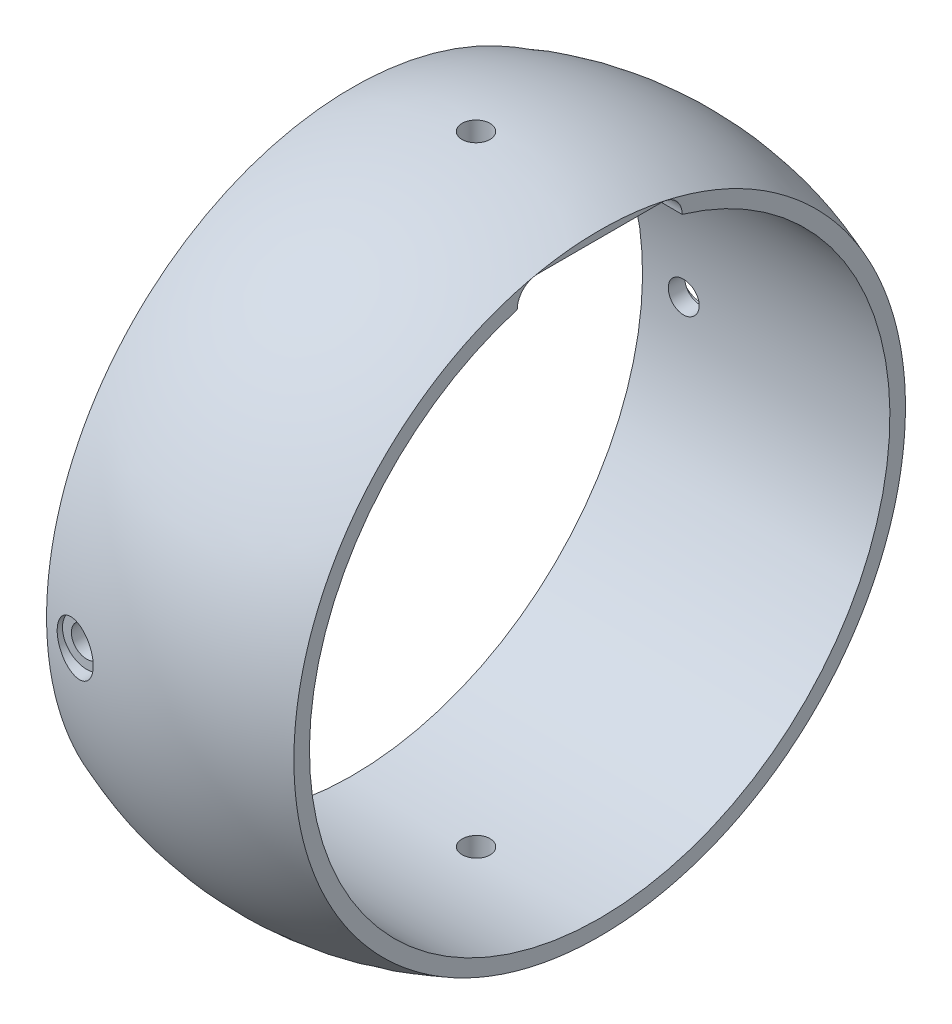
ISO-10303-21;
HEADER;
FILE_DESCRIPTION(('STEP AP214'),'2;1');
FILE_NAME('part.step','',(''),(''),'','','');
FILE_SCHEMA(('AUTOMOTIVE_DESIGN { 1 0 10303 214 1 1 1 1 }'));
ENDSEC;
DATA;
#1=APPLICATION_CONTEXT('core data for automotive mechanical design processes');
#2=APPLICATION_PROTOCOL_DEFINITION('international standard','automotive_design',2000,#1);
#3=PRODUCT_CONTEXT('',#1,'mechanical');
#4=PRODUCT('Part','Part','',(#3));
#5=PRODUCT_RELATED_PRODUCT_CATEGORY('part','',(#4));
#6=PRODUCT_DEFINITION_FORMATION('','',#4);
#7=PRODUCT_DEFINITION_CONTEXT('part definition',#1,'design');
#8=PRODUCT_DEFINITION('design','',#6,#7);
#9=PRODUCT_DEFINITION_SHAPE('','',#8);
#10=(LENGTH_UNIT() NAMED_UNIT(*) SI_UNIT(.MILLI.,.METRE.));
#11=(NAMED_UNIT(*) PLANE_ANGLE_UNIT() SI_UNIT($,.RADIAN.));
#12=(NAMED_UNIT(*) SI_UNIT($,.STERADIAN.) SOLID_ANGLE_UNIT());
#13=UNCERTAINTY_MEASURE_WITH_UNIT(LENGTH_MEASURE(1.E-05),#10,'distance_accuracy_value','');
#14=(GEOMETRIC_REPRESENTATION_CONTEXT(3) GLOBAL_UNCERTAINTY_ASSIGNED_CONTEXT((#13)) GLOBAL_UNIT_ASSIGNED_CONTEXT((#10,
#11,#12)) REPRESENTATION_CONTEXT('',''));
#15=CARTESIAN_POINT('',(0.,0.,0.));
#16=DIRECTION('',(0.,0.,1.));
#17=DIRECTION('',(1.,0.,0.));
#18=AXIS2_PLACEMENT_3D('',#15,#16,#17);
#19=CARTESIAN_POINT('',(3682.99517463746,92.074997,33.6688079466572));
#20=DIRECTION('',(0.,1.,0.));
#21=DIRECTION('',(0.999958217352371,0.,0.00914131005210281));
#22=AXIS2_PLACEMENT_3D('',#19,#20,#21);
#23=PLANE('',#22);
#24=DIRECTION('',(4.88798602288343E-11,0.,-1.));
#25=VECTOR('',#24,1.);
#26=CARTESIAN_POINT('',(38.1,92.074997,1.86232058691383E-09));
#27=LINE('',#26,#25);
#28=CARTESIAN_POINT('',(38.0999999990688,92.074997,19.0500000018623));
#29=VERTEX_POINT('',#28);
#30=CARTESIAN_POINT('',(38.1000000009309,92.074997,-19.0499999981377));
#31=VERTEX_POINT('',#30);
#32=EDGE_CURVE('E98',#29,#31,#27,.T.);
#33=ORIENTED_EDGE('',*,*,#32,.F.);
#34=DIRECTION('',(-1.,0.,-4.88798602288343E-11));
#35=VECTOR('',#34,1.);
#36=CARTESIAN_POINT('',(5.07999999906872,92.074997,19.0500000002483));
#37=LINE('',#36,#35);
#38=CARTESIAN_POINT('',(5.07999999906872,92.074997,19.0500000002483));
#39=VERTEX_POINT('',#38);
#40=EDGE_CURVE('E61',#29,#39,#37,.T.);
#41=ORIENTED_EDGE('',*,*,#40,.T.);
#42=DIRECTION('',(4.88798602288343E-11,0.,-1.));
#43=VECTOR('',#42,1.);
#44=CARTESIAN_POINT('',(5.07999999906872,92.074997,19.0500000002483));
#45=LINE('',#44,#43);
#46=CARTESIAN_POINT('',(5.08000000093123,92.074997,-19.0499999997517));
#47=VERTEX_POINT('',#46);
#48=EDGE_CURVE('E56',#47,#39,#45,.F.);
#49=ORIENTED_EDGE('',*,*,#48,.F.);
#50=DIRECTION('',(-1.,0.,-4.88798602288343E-11));
#51=VECTOR('',#50,1.);
#52=CARTESIAN_POINT('',(5.08000000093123,92.074997,-19.0499999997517));
#53=LINE('',#52,#51);
#54=EDGE_CURVE('E58',#47,#31,#53,.F.);
#55=ORIENTED_EDGE('',*,*,#54,.T.);
#56=EDGE_LOOP('',(#33,#41,#49,#55));
#57=FACE_BOUND('',#56,.T.);
#58=ADVANCED_FACE('F16',(#57),#23,.F.);
#59=CARTESIAN_POINT('',(-12.7000000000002,-3.00000000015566E-06,-6.20783413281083E-10));
#60=DIRECTION('',(1.,0.,4.88798602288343E-11));
#61=DIRECTION('',(0.,1.,0.));
#62=AXIS2_PLACEMENT_3D('',#59,#60,#61);
#63=CYLINDRICAL_SURFACE('',#62,89.408);
#64=CARTESIAN_POINT('',(38.1,-3.00000000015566E-06,1.86232058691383E-09));
#65=DIRECTION('',(1.,0.,4.88798602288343E-11));
#66=DIRECTION('',(-4.88798602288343E-11,0.,1.));
#67=AXIS2_PLACEMENT_3D('',#64,#65,#66);
#68=CIRCLE('',#67,89.408);
#69=CARTESIAN_POINT('',(38.1000000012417,85.7241503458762,-25.3999999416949));
#70=VERTEX_POINT('',#69);
#71=CARTESIAN_POINT('',(38.0999999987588,85.7241503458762,25.3999999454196));
#72=VERTEX_POINT('',#71);
#73=EDGE_CURVE('E189',#70,#72,#68,.F.);
#74=ORIENTED_EDGE('',*,*,#73,.F.);
#75=DIRECTION('',(1.,0.,4.88798602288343E-11));
#76=VECTOR('',#75,1.);
#77=CARTESIAN_POINT('',(5.08000000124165,85.7241503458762,-25.399999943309));
#78=LINE('',#77,#76);
#79=CARTESIAN_POINT('',(5.0800000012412,85.7241503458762,-25.399999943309));
#80=VERTEX_POINT('',#79);
#81=EDGE_CURVE('E170',#80,#70,#78,.T.);
#82=ORIENTED_EDGE('',*,*,#81,.F.);
#83=CARTESIAN_POINT('',(5.08000000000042,-3.00000000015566E-06,2.48306109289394E-10));
#84=DIRECTION('',(1.,0.,4.88798602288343E-11));
#85=DIRECTION('',(-4.88798602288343E-11,0.,1.));
#86=AXIS2_PLACEMENT_3D('',#83,#84,#85);
#87=CIRCLE('',#86,89.408);
#88=CARTESIAN_POINT('',(5.07999999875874,85.7241503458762,25.3999999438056));
#89=VERTEX_POINT('',#88);
#90=EDGE_CURVE('E82',#89,#80,#87,.F.);
#91=ORIENTED_EDGE('',*,*,#90,.F.);
#92=DIRECTION('',(1.,0.,4.88798602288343E-11));
#93=VECTOR('',#92,1.);
#94=CARTESIAN_POINT('',(38.0999999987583,85.7241503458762,25.3999999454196));
#95=LINE('',#94,#93);
#96=EDGE_CURVE('E35',#72,#89,#95,.F.);
#97=ORIENTED_EDGE('',*,*,#96,.F.);
#98=EDGE_LOOP('',(#74,#82,#91,#97));
#99=FACE_BOUND('',#98,.T.);
#100=CARTESIAN_POINT('',(4.30529999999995,89.407997,2.10433626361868E-10));
#101=CARTESIAN_POINT('',(4.30529933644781,89.4079969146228,0.120790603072));
#102=CARTESIAN_POINT('',(4.30021234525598,89.407751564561,0.241602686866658));
#103=CARTESIAN_POINT('',(4.27989417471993,89.4067766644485,0.482416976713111));
#104=CARTESIAN_POINT('',(4.26465801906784,89.4060468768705,0.60241875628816));
#105=CARTESIAN_POINT('',(4.22411173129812,89.4041219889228,0.840917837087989));
#106=CARTESIAN_POINT('',(4.19878449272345,89.4029260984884,0.959412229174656));
#107=CARTESIAN_POINT('',(4.13822618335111,89.4001024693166,1.19388416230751));
#108=CARTESIAN_POINT('',(4.10299138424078,89.3984745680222,1.30986073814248));
#109=CARTESIAN_POINT('',(4.02292419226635,89.394835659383,1.53828399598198));
#110=CARTESIAN_POINT('',(3.97810378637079,89.392825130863,1.65073488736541));
#111=CARTESIAN_POINT('',(3.8791407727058,89.3884758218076,1.87150024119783));
#112=CARTESIAN_POINT('',(3.82499472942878,89.3861369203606,1.97981316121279));
#113=CARTESIAN_POINT('',(3.70782653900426,89.381199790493,2.19140202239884));
#114=CARTESIAN_POINT('',(3.6448118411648,89.3786017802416,2.29468209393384));
#115=CARTESIAN_POINT('',(3.51029463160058,89.3732173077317,2.49560847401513));
#116=CARTESIAN_POINT('',(3.43878899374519,89.3704307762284,2.59325268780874));
#117=CARTESIAN_POINT('',(3.28777410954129,89.3647474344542,2.78222693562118));
#118=CARTESIAN_POINT('',(3.20826048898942,89.3618505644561,2.8735534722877));
#119=CARTESIAN_POINT('',(3.04179541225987,89.3560290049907,3.04921898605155));
#120=CARTESIAN_POINT('',(2.95484121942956,89.3531043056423,3.13355536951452));
#121=CARTESIAN_POINT('',(2.77416221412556,89.3473119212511,3.29458215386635));
#122=CARTESIAN_POINT('',(2.68043930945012,89.3444442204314,3.37127469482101));
#123=CARTESIAN_POINT('',(2.48682971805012,89.3388452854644,3.51652344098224));
#124=CARTESIAN_POINT('',(2.38694076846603,89.3361141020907,3.58507663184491));
#125=CARTESIAN_POINT('',(2.1817295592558,89.3308666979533,3.713531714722));
#126=CARTESIAN_POINT('',(2.07640685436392,89.3283504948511,3.77343289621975));
#127=CARTESIAN_POINT('',(1.86104608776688,89.3236039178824,3.88417095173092));
#128=CARTESIAN_POINT('',(1.75100629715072,89.3213736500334,3.93500446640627));
#129=CARTESIAN_POINT('',(1.52706292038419,89.3172644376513,4.02719966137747));
#130=CARTESIAN_POINT('',(1.41316084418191,89.3153853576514,4.06856499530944));
#131=CARTESIAN_POINT('',(1.18225835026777,89.3120298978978,4.14156481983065));
#132=CARTESIAN_POINT('',(1.06525679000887,89.3105536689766,4.17319566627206));
#133=CARTESIAN_POINT('',(0.711136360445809,89.30680060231,4.25303322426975));
#134=CARTESIAN_POINT('',(0.470480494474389,89.3051914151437,4.28635786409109));
#135=CARTESIAN_POINT('',(-0.0130129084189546,89.3039532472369,4.31208128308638));
#136=CARTESIAN_POINT('',(-0.25585043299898,89.3043242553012,4.30448029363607));
#137=CARTESIAN_POINT('',(-0.616259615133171,89.3063240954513,4.26268831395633));
#138=CARTESIAN_POINT('',(-0.735768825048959,89.307231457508,4.24368849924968));
#139=CARTESIAN_POINT('',(-0.972746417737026,89.3094987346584,4.19570769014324));
#140=CARTESIAN_POINT('',(-1.09021554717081,89.3108584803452,4.16673043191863));
#141=CARTESIAN_POINT('',(-1.32233077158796,89.3139932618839,4.09898506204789));
#142=CARTESIAN_POINT('',(-1.43697576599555,89.3157684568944,4.06021319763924));
#143=CARTESIAN_POINT('',(-1.66255133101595,89.3196825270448,3.97317737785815));
#144=CARTESIAN_POINT('',(-1.77348325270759,89.3218212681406,3.92491692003));
#145=CARTESIAN_POINT('',(-1.99097834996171,89.3264041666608,3.81919446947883));
#146=CARTESIAN_POINT('',(-2.09753784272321,89.3288485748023,3.7617249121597));
#147=CARTESIAN_POINT('',(-2.30539803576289,89.3339710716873,3.63804454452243));
#148=CARTESIAN_POINT('',(-2.40670065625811,89.3366490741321,3.57183695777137));
#149=CARTESIAN_POINT('',(-2.60340059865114,89.3421644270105,3.43111369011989));
#150=CARTESIAN_POINT('',(-2.69879620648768,89.3450018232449,3.35659561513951));
#151=CARTESIAN_POINT('',(-2.882941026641,89.3507537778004,3.19982427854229));
#152=CARTESIAN_POINT('',(-2.97169267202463,89.3536683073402,3.11757387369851));
#153=CARTESIAN_POINT('',(-3.14206229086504,89.3594965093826,2.94579421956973));
#154=CARTESIAN_POINT('',(-3.22367161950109,89.3624101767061,2.85625639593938));
#155=CARTESIAN_POINT('',(-3.37902974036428,89.3681494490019,2.67065658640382));
#156=CARTESIAN_POINT('',(-3.45278141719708,89.3709750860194,2.57459701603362));
#157=CARTESIAN_POINT('',(-3.59199381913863,89.3764616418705,2.37652146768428));
#158=CARTESIAN_POINT('',(-3.65744751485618,89.3791224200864,2.27450054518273));
#159=CARTESIAN_POINT('',(-3.77950252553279,89.3842001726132,2.06533890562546));
#160=CARTESIAN_POINT('',(-3.83610710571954,89.3866172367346,1.95820009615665));
#161=CARTESIAN_POINT('',(-3.94015380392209,89.3911428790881,1.7393935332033));
#162=CARTESIAN_POINT('',(-3.98758452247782,89.3932510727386,1.62772035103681));
#163=CARTESIAN_POINT('',(-4.07284076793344,89.3970946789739,1.40080676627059));
#164=CARTESIAN_POINT('',(-4.11066991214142,89.3988302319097,1.28556772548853));
#165=CARTESIAN_POINT('',(-4.17641887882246,89.4018775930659,1.05250664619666));
#166=CARTESIAN_POINT('',(-4.20435549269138,89.4031901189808,0.934689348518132));
#167=CARTESIAN_POINT('',(-4.25019880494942,89.4053576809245,0.697163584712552));
#168=CARTESIAN_POINT('',(-4.26811042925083,89.4062129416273,0.57745607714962));
#169=CARTESIAN_POINT('',(-4.28906137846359,89.4072161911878,0.381305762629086));
#170=CARTESIAN_POINT('',(-4.29514892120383,89.4075086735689,0.305176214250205));
#171=CARTESIAN_POINT('',(-4.30326844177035,89.407899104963,0.15270063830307));
#172=CARTESIAN_POINT('',(-4.30530041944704,89.4079970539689,0.0763546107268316));
#173=CARTESIAN_POINT('',(-4.30529933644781,89.4079969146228,-0.120790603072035));
#174=CARTESIAN_POINT('',(-4.30021234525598,89.407751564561,-0.241602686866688));
#175=CARTESIAN_POINT('',(-4.27989417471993,89.4067766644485,-0.482416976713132));
#176=CARTESIAN_POINT('',(-4.26465801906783,89.4060468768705,-0.602418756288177));
#177=CARTESIAN_POINT('',(-4.22411173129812,89.4041219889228,-0.840917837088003));
#178=CARTESIAN_POINT('',(-4.19878449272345,89.4029260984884,-0.959412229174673));
#179=CARTESIAN_POINT('',(-4.13822618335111,89.4001024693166,-1.19388416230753));
#180=CARTESIAN_POINT('',(-4.10299138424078,89.3984745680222,-1.3098607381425));
#181=CARTESIAN_POINT('',(-4.02292419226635,89.394835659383,-1.53828399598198));
#182=CARTESIAN_POINT('',(-3.97810378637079,89.392825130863,-1.6507348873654));
#183=CARTESIAN_POINT('',(-3.87914077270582,89.3884758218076,-1.87150024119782));
#184=CARTESIAN_POINT('',(-3.82499472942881,89.3861369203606,-1.97981316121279));
#185=CARTESIAN_POINT('',(-3.70782653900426,89.381199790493,-2.19140202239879));
#186=CARTESIAN_POINT('',(-3.64481184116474,89.3786017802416,-2.29468209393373));
#187=CARTESIAN_POINT('',(-3.51029463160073,89.3732173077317,-2.49560847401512));
#188=CARTESIAN_POINT('',(-3.4387889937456,89.3704307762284,-2.59325268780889));
#189=CARTESIAN_POINT('',(-3.28777410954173,89.3647474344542,-2.78222693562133));
#190=CARTESIAN_POINT('',(-3.2082604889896,89.3618505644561,-2.87355347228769));
#191=CARTESIAN_POINT('',(-3.04179541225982,89.3560290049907,-3.04921898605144));
#192=CARTESIAN_POINT('',(-2.95484121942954,89.3531043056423,-3.13355536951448));
#193=CARTESIAN_POINT('',(-2.77416221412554,89.3473119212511,-3.29458215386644));
#194=CARTESIAN_POINT('',(-2.68043930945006,89.3444442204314,-3.37127469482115));
#195=CARTESIAN_POINT('',(-2.48682971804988,89.3388452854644,-3.51652344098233));
#196=CARTESIAN_POINT('',(-2.38694076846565,89.3361141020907,-3.5850766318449));
#197=CARTESIAN_POINT('',(-2.18172955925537,89.3308666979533,-3.713531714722));
#198=CARTESIAN_POINT('',(-2.07640685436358,89.3283504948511,-3.77343289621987));
#199=CARTESIAN_POINT('',(-1.86104608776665,89.3236039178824,-3.8841709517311));
#200=CARTESIAN_POINT('',(-1.75100629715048,89.3213736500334,-3.9350044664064));
#201=CARTESIAN_POINT('',(-1.52706292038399,89.3172644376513,-4.02719966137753));
#202=CARTESIAN_POINT('',(-1.41316084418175,89.3153853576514,-4.06856499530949));
#203=CARTESIAN_POINT('',(-1.18225835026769,89.3120298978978,-4.14156481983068));
#204=CARTESIAN_POINT('',(-1.06525679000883,89.3105536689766,-4.17319566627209));
#205=CARTESIAN_POINT('',(-0.711136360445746,89.3068006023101,-4.25303322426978));
#206=CARTESIAN_POINT('',(-0.470480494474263,89.3051914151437,-4.28635786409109));
#207=CARTESIAN_POINT('',(0.0130129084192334,89.3039532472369,-4.31208128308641));
#208=CARTESIAN_POINT('',(0.255850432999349,89.3043242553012,-4.30448029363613));
#209=CARTESIAN_POINT('',(0.616259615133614,89.3063240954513,-4.26268831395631));
#210=CARTESIAN_POINT('',(0.735768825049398,89.307231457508,-4.24368849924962));
#211=CARTESIAN_POINT('',(0.972746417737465,89.3094987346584,-4.19570769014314));
#212=CARTESIAN_POINT('',(1.09021554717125,89.3108584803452,-4.16673043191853));
#213=CARTESIAN_POINT('',(1.32233077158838,89.313993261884,-4.09898506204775));
#214=CARTESIAN_POINT('',(1.43697576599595,89.3157684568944,-4.06021319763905));
#215=CARTESIAN_POINT('',(1.66255133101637,89.3196825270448,-3.97317737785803));
#216=CARTESIAN_POINT('',(1.77348325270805,89.3218212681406,-3.92491692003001));
#217=CARTESIAN_POINT('',(1.99097834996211,89.3264041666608,-3.81919446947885));
#218=CARTESIAN_POINT('',(2.0975378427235,89.3288485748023,-3.7617249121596));
#219=CARTESIAN_POINT('',(2.30539803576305,89.3339710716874,-3.63804454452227));
#220=CARTESIAN_POINT('',(2.40670065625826,89.3366490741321,-3.57183695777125));
#221=CARTESIAN_POINT('',(2.60340059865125,89.3421644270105,-3.43111369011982));
#222=CARTESIAN_POINT('',(2.69879620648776,89.3450018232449,-3.35659561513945));
#223=CARTESIAN_POINT('',(2.88294102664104,89.3507537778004,-3.19982427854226));
#224=CARTESIAN_POINT('',(2.97169267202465,89.3536683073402,-3.11757387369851));
#225=CARTESIAN_POINT('',(3.14206229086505,89.3594965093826,-2.94579421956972));
#226=CARTESIAN_POINT('',(3.22367161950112,89.3624101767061,-2.85625639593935));
#227=CARTESIAN_POINT('',(3.37902974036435,89.3681494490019,-2.67065658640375));
#228=CARTESIAN_POINT('',(3.45278141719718,89.3709750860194,-2.57459701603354));
#229=CARTESIAN_POINT('',(3.59199381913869,89.3764616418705,-2.37652146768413));
#230=CARTESIAN_POINT('',(3.65744751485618,89.3791224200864,-2.27450054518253));
#231=CARTESIAN_POINT('',(3.77950252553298,89.3842001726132,-2.06533890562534));
#232=CARTESIAN_POINT('',(3.83610710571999,89.3866172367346,-1.95820009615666));
#233=CARTESIAN_POINT('',(3.94015380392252,89.3911428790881,-1.73939353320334));
#234=CARTESIAN_POINT('',(3.98758452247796,89.3932510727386,-1.62772035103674));
#235=CARTESIAN_POINT('',(4.07284076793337,89.3970946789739,-1.40080676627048));
#236=CARTESIAN_POINT('',(4.11066991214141,89.3988302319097,-1.28556772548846));
#237=CARTESIAN_POINT('',(4.17641887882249,89.4018775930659,-1.05250664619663));
#238=CARTESIAN_POINT('',(4.20435549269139,89.4031901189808,-0.934689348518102));
#239=CARTESIAN_POINT('',(4.25019880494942,89.4053576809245,-0.697163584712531));
#240=CARTESIAN_POINT('',(4.26811042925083,89.4062129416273,-0.577456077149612));
#241=CARTESIAN_POINT('',(4.28906137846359,89.4072161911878,-0.381305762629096));
#242=CARTESIAN_POINT('',(4.29514892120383,89.4075086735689,-0.305176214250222));
#243=CARTESIAN_POINT('',(4.30326844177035,89.407899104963,-0.152700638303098));
#244=CARTESIAN_POINT('',(4.30530041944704,89.4079970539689,-0.0763546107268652));
#245=CARTESIAN_POINT('',(4.30529999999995,89.407997,2.10433626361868E-10));
#246=B_SPLINE_CURVE_WITH_KNOTS('',3,(#100,#101,#102,#103,#104,#105,#106,#107,#108,#109,#110,
#111,#112,#113,#114,#115,#116,#117,#118,#119,#120,#121,#122,#123,#124,#125,#126,#127,#128,#129,
#130,#131,#132,#133,#134,#135,#136,#137,#138,#139,#140,#141,#142,#143,#144,#145,#146,#147,#148,
#149,#150,#151,#152,#153,#154,#155,#156,#157,#158,#159,#160,#161,#162,#163,#164,#165,#166,#167,
#168,#169,#170,#171,#172,#173,#174,#175,#176,#177,#178,#179,#180,#181,#182,#183,#184,#185,#186,
#187,#188,#189,#190,#191,#192,#193,#194,#195,#196,#197,#198,#199,#200,#201,#202,#203,#204,#205,
#206,#207,#208,#209,#210,#211,#212,#213,#214,#215,#216,#217,#218,#219,#220,#221,#222,#223,#224,
#225,#226,#227,#228,#229,#230,#231,#232,#233,#234,#235,#236,#237,#238,#239,#240,#241,#242,#243,
#244,#245),.UNSPECIFIED.,.T.,.F.,(4,2,2,2,2,2,2,2,2,2,2,2,2,2,2,2,2,2,2,2,2,2,2,2,2,2,2,2,2,2,2,
2,2,2,2,2,2,2,2,2,2,2,2,2,2,2,2,2,2,2,2,2,2,2,2,2,2,2,2,2,2,2,2,2,2,2,2,2,2,2,2,2,4),(0.,
0.362301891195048,0.724781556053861,1.08787833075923,1.45111192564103,1.81389391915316,
2.17680984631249,2.5394227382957,2.90216955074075,3.26511559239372,3.62819570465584,
3.99117387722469,4.35428605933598,4.71742804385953,5.08070428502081,5.44384010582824,
5.80711170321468,6.53230606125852,7.25749631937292,7.62017782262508,7.98272366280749,
8.34540862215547,8.7079601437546,9.07081101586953,9.43352840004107,9.79635054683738,
10.1590391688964,10.5221608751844,10.8851488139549,11.2484422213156,11.6116012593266,
11.9752087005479,12.3386789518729,12.7015292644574,13.064201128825,13.2932207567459,
13.5222403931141,13.8845422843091,14.2470219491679,14.6101187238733,14.9733523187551,
15.3361343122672,15.6990502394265,16.0616631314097,16.4244099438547,16.7873559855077,
17.15043609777,17.513414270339,17.8765264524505,18.2396684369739,18.6029446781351,
18.9660804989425,19.3293520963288,20.0545464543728,20.7797367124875,21.1424182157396,
21.504964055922,21.86764901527,22.2302005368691,22.5930514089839,22.9557687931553,
23.3185909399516,23.6812795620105,24.0444012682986,24.4073892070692,24.7706826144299,
25.1338416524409,25.4974490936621,25.8609193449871,26.2237696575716,26.5864415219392,
26.8154611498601,27.0444807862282),.UNSPECIFIED.);
#247=CARTESIAN_POINT('',(4.30529999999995,89.407997,2.10433626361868E-10));
#248=VERTEX_POINT('',#247);
#249=EDGE_CURVE('E179',#248,#248,#246,.T.);
#250=ORIENTED_EDGE('',*,*,#249,.F.);
#251=EDGE_LOOP('',(#250));
#252=FACE_BOUND('',#251,.T.);
#253=CARTESIAN_POINT('',(-38.1,-3.00000000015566E-06,-1.86233194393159E-09));
#254=DIRECTION('',(1.,0.,4.88798602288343E-11));
#255=DIRECTION('',(-4.88798602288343E-11,0.,1.));
#256=AXIS2_PLACEMENT_3D('',#253,#254,#255);
#257=CIRCLE('',#256,89.408);
#258=CARTESIAN_POINT('',(-38.1000000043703,-3.00000000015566E-06,89.4079999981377));
#259=VERTEX_POINT('',#258);
#260=EDGE_CURVE('E26',#259,#259,#257,.T.);
#261=ORIENTED_EDGE('',*,*,#260,.F.);
#262=EDGE_LOOP('',(#261));
#263=FACE_BOUND('',#262,.T.);
#264=CARTESIAN_POINT('',(-30.1625000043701,-2.99999999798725E-06,89.4079999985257));
#265=CARTESIAN_POINT('',(-30.1624992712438,0.133595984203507,89.4079998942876));
#266=CARTESIAN_POINT('',(-30.156873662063,0.267218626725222,89.407699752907));
#267=CARTESIAN_POINT('',(-30.1344042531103,0.533567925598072,89.4065071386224));
#268=CARTESIAN_POINT('',(-30.1175549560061,0.666294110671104,89.4056143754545));
#269=CARTESIAN_POINT('',(-30.0727160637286,0.930081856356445,89.4032596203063));
#270=CARTESIAN_POINT('',(-30.0447075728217,1.06114020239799,89.4017966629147));
#271=CARTESIAN_POINT('',(-29.9777387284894,1.32047286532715,89.3983424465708));
#272=CARTESIAN_POINT('',(-29.9387742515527,1.44874611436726,89.3963509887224));
#273=CARTESIAN_POINT('',(-29.8502327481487,1.70138730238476,89.3918993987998));
#274=CARTESIAN_POINT('',(-29.8006690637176,1.82575992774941,89.3894398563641));
#275=CARTESIAN_POINT('',(-29.6912337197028,2.06993056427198,89.3841191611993));
#276=CARTESIAN_POINT('',(-29.6313582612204,2.1897268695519,89.3812578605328));
#277=CARTESIAN_POINT('',(-29.5017926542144,2.42374965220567,89.3752179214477));
#278=CARTESIAN_POINT('',(-29.4321107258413,2.53798068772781,89.3720395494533));
#279=CARTESIAN_POINT('',(-29.2833615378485,2.76021338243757,89.365452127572));
#280=CARTESIAN_POINT('',(-29.2042908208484,2.8682127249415,89.3620429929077));
#281=CARTESIAN_POINT('',(-29.037285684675,3.07724713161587,89.3550890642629));
#282=CARTESIAN_POINT('',(-28.9493450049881,3.1782771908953,89.3515441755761));
#283=CARTESIAN_POINT('',(-28.7652360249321,3.37260944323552,89.3444201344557));
#284=CARTESIAN_POINT('',(-28.6690646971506,3.4659087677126,89.3408409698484));
#285=CARTESIAN_POINT('',(-28.4692318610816,3.64405160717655,89.3337521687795));
#286=CARTESIAN_POINT('',(-28.3655724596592,3.72889748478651,89.330242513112));
#287=CARTESIAN_POINT('',(-28.1514341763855,3.8895911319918,89.3233899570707));
#288=CARTESIAN_POINT('',(-28.0409527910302,3.9654355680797,89.3200471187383));
#289=CARTESIAN_POINT('',(-27.8139654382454,4.10756448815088,89.3136239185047));
#290=CARTESIAN_POINT('',(-27.6974583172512,4.17384713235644,89.3105436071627));
#291=CARTESIAN_POINT('',(-27.4592246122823,4.29638529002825,89.3047326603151));
#292=CARTESIAN_POINT('',(-27.3374961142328,4.35263708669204,89.3020021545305));
#293=CARTESIAN_POINT('',(-27.0897616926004,4.45466216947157,89.2969710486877));
#294=CARTESIAN_POINT('',(-26.9637574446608,4.50043950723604,89.2946702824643));
#295=CARTESIAN_POINT('',(-26.7083183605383,4.58122865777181,89.2905616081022));
#296=CARTESIAN_POINT('',(-26.5788822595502,4.61623643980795,89.2887538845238));
#297=CARTESIAN_POINT('',(-26.1871688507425,4.70459282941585,89.2841582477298));
#298=CARTESIAN_POINT('',(-25.9209764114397,4.74148389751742,89.2821871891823));
#299=CARTESIAN_POINT('',(-25.3861721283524,4.76999922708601,89.2806684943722));
#300=CARTESIAN_POINT('',(-25.1175603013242,4.76162380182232,89.2811208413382));
#301=CARTESIAN_POINT('',(-24.7189206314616,4.71544938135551,89.2835656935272));
#302=CARTESIAN_POINT('',(-24.586750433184,4.69445506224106,89.2846750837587));
#303=CARTESIAN_POINT('',(-24.324665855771,4.64143078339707,89.2874475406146));
#304=CARTESIAN_POINT('',(-24.1947506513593,4.60940495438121,89.2891103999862));
#305=CARTESIAN_POINT('',(-23.9380408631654,4.53452823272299,89.2929442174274));
#306=CARTESIAN_POINT('',(-23.8112474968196,4.491673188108,89.2951153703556));
#307=CARTESIAN_POINT('',(-23.5617667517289,4.39546847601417,89.2999026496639));
#308=CARTESIAN_POINT('',(-23.4390778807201,4.34212267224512,89.3025186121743));
#309=CARTESIAN_POINT('',(-23.1985179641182,4.22525229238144,89.3081245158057));
#310=CARTESIAN_POINT('',(-23.0806514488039,4.16171840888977,89.3111147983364));
#311=CARTESIAN_POINT('',(-22.8507321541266,4.02498428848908,89.3173814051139));
#312=CARTESIAN_POINT('',(-22.7386772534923,3.95178761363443,89.3206576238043));
#313=CARTESIAN_POINT('',(-22.5210954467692,3.79620653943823,89.3274051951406));
#314=CARTESIAN_POINT('',(-22.4155704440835,3.71381948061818,89.3308766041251));
#315=CARTESIAN_POINT('',(-22.2118675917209,3.54049073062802,89.3379140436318));
#316=CARTESIAN_POINT('',(-22.1136870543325,3.44955219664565,89.3414800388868));
#317=CARTESIAN_POINT('',(-21.9251899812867,3.25960279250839,89.3486120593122));
#318=CARTESIAN_POINT('',(-21.8348848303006,3.16058062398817,89.3521780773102));
#319=CARTESIAN_POINT('',(-21.6629677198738,2.95531621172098,89.3592026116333));
#320=CARTESIAN_POINT('',(-21.5813525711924,2.84907664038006,89.3626611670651));
#321=CARTESIAN_POINT('',(-21.4272917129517,2.63000496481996,89.3693769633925));
#322=CARTESIAN_POINT('',(-21.3548537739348,2.51716739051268,89.3726340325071));
#323=CARTESIAN_POINT('',(-21.2197687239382,2.28582461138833,89.3788500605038));
#324=CARTESIAN_POINT('',(-21.1571179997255,2.16732151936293,89.3818091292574));
#325=CARTESIAN_POINT('',(-21.0419504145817,1.92530008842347,89.3873499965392));
#326=CARTESIAN_POINT('',(-20.98944623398,1.80177570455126,89.3899313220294));
#327=CARTESIAN_POINT('',(-20.895062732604,1.55077619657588,89.3946379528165));
#328=CARTESIAN_POINT('',(-20.8531794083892,1.42330258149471,89.3967634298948));
#329=CARTESIAN_POINT('',(-20.7803747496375,1.16549336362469,89.4004959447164));
#330=CARTESIAN_POINT('',(-20.7494348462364,1.03516301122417,89.40210386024));
#331=CARTESIAN_POINT('',(-20.6986510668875,0.772406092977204,89.4047598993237));
#332=CARTESIAN_POINT('',(-20.6788017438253,0.639980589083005,89.4058082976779));
#333=CARTESIAN_POINT('',(-20.6555485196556,0.422795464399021,89.4070400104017));
#334=CARTESIAN_POINT('',(-20.6487824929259,0.338382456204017,89.4073996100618));
#335=CARTESIAN_POINT('',(-20.6397580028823,0.169315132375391,89.4078796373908));
#336=CARTESIAN_POINT('',(-20.6374995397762,0.0846608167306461,89.4080000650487));
#337=CARTESIAN_POINT('',(-20.6375007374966,-0.133601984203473,89.4079998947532));
#338=CARTESIAN_POINT('',(-20.6431263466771,-0.267224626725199,89.4076997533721));
#339=CARTESIAN_POINT('',(-20.6655957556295,-0.53357392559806,89.4065071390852));
#340=CARTESIAN_POINT('',(-20.6824450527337,-0.666300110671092,89.4056143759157));
#341=CARTESIAN_POINT('',(-20.7272839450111,-0.930087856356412,89.4032596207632));
#342=CARTESIAN_POINT('',(-20.7552924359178,-1.06114620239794,89.4017966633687));
#343=CARTESIAN_POINT('',(-20.8222612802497,-1.32047886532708,89.3983424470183));
#344=CARTESIAN_POINT('',(-20.8612257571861,-1.44875211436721,89.3963509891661));
#345=CARTESIAN_POINT('',(-20.9497672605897,-1.70139330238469,89.3918993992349));
#346=CARTESIAN_POINT('',(-20.9993309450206,-1.82576592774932,89.3894398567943));
#347=CARTESIAN_POINT('',(-21.1087662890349,-2.06993656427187,89.3841191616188));
#348=CARTESIAN_POINT('',(-21.168641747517,-2.1897328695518,89.3812578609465));
#349=CARTESIAN_POINT('',(-21.2982073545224,-2.42375565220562,89.3752179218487));
#350=CARTESIAN_POINT('',(-21.3678892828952,-2.53798668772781,89.3720395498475));
#351=CARTESIAN_POINT('',(-21.5166384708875,-2.76021938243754,89.3654521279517));
#352=CARTESIAN_POINT('',(-21.5957091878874,-2.86821872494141,89.3620429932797));
#353=CARTESIAN_POINT('',(-21.7627143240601,-3.07725313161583,89.3550890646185));
#354=CARTESIAN_POINT('',(-21.8506550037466,-3.17828319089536,89.3515441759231));
#355=CARTESIAN_POINT('',(-22.0347639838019,-3.37261544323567,89.3444201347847));
#356=CARTESIAN_POINT('',(-22.1309353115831,-3.46591476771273,89.3408409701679));
#357=CARTESIAN_POINT('',(-22.3307681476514,-3.64405760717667,89.3337521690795));
#358=CARTESIAN_POINT('',(-22.4344275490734,-3.72890348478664,89.330242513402));
#359=CARTESIAN_POINT('',(-22.6485658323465,-3.88959713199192,89.3233899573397));
#360=CARTESIAN_POINT('',(-22.7590472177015,-3.96544156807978,89.3200471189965));
#361=CARTESIAN_POINT('',(-22.9860345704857,-4.10757048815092,89.3136239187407));
#362=CARTESIAN_POINT('',(-23.1025416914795,-4.17385313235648,89.3105436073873));
#363=CARTESIAN_POINT('',(-23.3407753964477,-4.29639129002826,89.3047326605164));
#364=CARTESIAN_POINT('',(-23.4625038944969,-4.35264308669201,89.3020021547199));
#365=CARTESIAN_POINT('',(-23.7102383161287,-4.4546681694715,89.2969710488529));
#366=CARTESIAN_POINT('',(-23.836242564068,-4.50044550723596,89.2946702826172));
#367=CARTESIAN_POINT('',(-24.09168164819,-4.58123465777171,89.2905616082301));
#368=CARTESIAN_POINT('',(-24.2211177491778,-4.61624243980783,89.288753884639));
#369=CARTESIAN_POINT('',(-24.6128311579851,-4.70459882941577,89.2841582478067));
#370=CARTESIAN_POINT('',(-24.8790235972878,-4.74148989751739,89.2821871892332));
#371=CARTESIAN_POINT('',(-25.4138278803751,-4.77000522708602,89.2806684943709));
#372=CARTESIAN_POINT('',(-25.6824397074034,-4.76162980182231,89.2811208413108));
#373=CARTESIAN_POINT('',(-26.0810793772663,-4.7154553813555,89.2835656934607));
#374=CARTESIAN_POINT('',(-26.2132495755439,-4.69446106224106,89.2846750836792));
#375=CARTESIAN_POINT('',(-26.4753341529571,-4.64143678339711,89.2874475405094));
#376=CARTESIAN_POINT('',(-26.6052493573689,-4.60941095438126,89.2891103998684));
#377=CARTESIAN_POINT('',(-26.8619591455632,-4.53453423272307,89.2929442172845));
#378=CARTESIAN_POINT('',(-26.9887525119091,-4.4916791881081,89.2951153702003));
#379=CARTESIAN_POINT('',(-27.2382332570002,-4.39547447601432,89.2999026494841));
#380=CARTESIAN_POINT('',(-27.3609221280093,-4.3421286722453,89.3025186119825));
#381=CARTESIAN_POINT('',(-27.6014820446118,-4.22525829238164,89.3081245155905));
#382=CARTESIAN_POINT('',(-27.7193485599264,-4.16172440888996,89.3111147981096));
#383=CARTESIAN_POINT('',(-27.9492678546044,-4.02499028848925,89.3173814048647));
#384=CARTESIAN_POINT('',(-28.061322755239,-3.9517936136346,89.3206576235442));
#385=CARTESIAN_POINT('',(-28.2789045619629,-3.79621253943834,89.3274051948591));
#386=CARTESIAN_POINT('',(-28.3844295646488,-3.71382548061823,89.3308766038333));
#387=CARTESIAN_POINT('',(-28.5881324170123,-3.54049673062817,89.3379140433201));
#388=CARTESIAN_POINT('',(-28.6863129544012,-3.44955819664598,89.3414800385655));
#389=CARTESIAN_POINT('',(-28.8748100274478,-3.25960879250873,89.3486120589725));
#390=CARTESIAN_POINT('',(-28.965115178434,-3.16058662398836,89.3521780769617));
#391=CARTESIAN_POINT('',(-29.1370322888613,-2.95532221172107,89.359202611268));
#392=CARTESIAN_POINT('',(-29.2186474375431,-2.84908264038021,89.3626611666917));
#393=CARTESIAN_POINT('',(-29.3727082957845,-2.63001096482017,89.3693769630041));
#394=CARTESIAN_POINT('',(-29.4451462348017,-2.51717339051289,89.3726340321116));
#395=CARTESIAN_POINT('',(-29.5802312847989,-2.28583061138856,89.3788500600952));
#396=CARTESIAN_POINT('',(-29.6428820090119,-2.16732751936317,89.3818091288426));
#397=CARTESIAN_POINT('',(-29.7580495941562,-1.92530608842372,89.3873499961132));
#398=CARTESIAN_POINT('',(-29.8105537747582,-1.80178170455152,89.3899313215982));
#399=CARTESIAN_POINT('',(-29.9049372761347,-1.55078219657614,89.3946379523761));
#400=CARTESIAN_POINT('',(-29.9468206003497,-1.42330858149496,89.3967634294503));
#401=CARTESIAN_POINT('',(-30.0196252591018,-1.16549936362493,89.4004959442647));
#402=CARTESIAN_POINT('',(-30.0505651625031,-1.0351690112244,89.4021038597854));
#403=CARTESIAN_POINT('',(-30.1013489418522,-0.772412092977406,89.4047598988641));
#404=CARTESIAN_POINT('',(-30.1211982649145,-0.639986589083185,89.4058082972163));
#405=CARTESIAN_POINT('',(-30.1444514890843,-0.422801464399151,89.4070400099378));
#406=CARTESIAN_POINT('',(-30.1512175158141,-0.338388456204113,89.4073996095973));
#407=CARTESIAN_POINT('',(-30.1602420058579,-0.169321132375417,89.4078796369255));
#408=CARTESIAN_POINT('',(-30.1625004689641,-0.0846668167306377,89.4080000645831));
#409=CARTESIAN_POINT('',(-30.1625000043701,-2.99999999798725E-06,89.4079999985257));
#410=B_SPLINE_CURVE_WITH_KNOTS('',3,(#264,#265,#266,#267,#268,#269,#270,#271,#272,#273,#274,
#275,#276,#277,#278,#279,#280,#281,#282,#283,#284,#285,#286,#287,#288,#289,#290,#291,#292,#293,
#294,#295,#296,#297,#298,#299,#300,#301,#302,#303,#304,#305,#306,#307,#308,#309,#310,#311,#312,
#313,#314,#315,#316,#317,#318,#319,#320,#321,#322,#323,#324,#325,#326,#327,#328,#329,#330,#331,
#332,#333,#334,#335,#336,#337,#338,#339,#340,#341,#342,#343,#344,#345,#346,#347,#348,#349,#350,
#351,#352,#353,#354,#355,#356,#357,#358,#359,#360,#361,#362,#363,#364,#365,#366,#367,#368,#369,
#370,#371,#372,#373,#374,#375,#376,#377,#378,#379,#380,#381,#382,#383,#384,#385,#386,#387,#388,
#389,#390,#391,#392,#393,#394,#395,#396,#397,#398,#399,#400,#401,#402,#403,#404,#405,#406,#407,
#408,#409),.UNSPECIFIED.,.T.,.F.,(4,2,2,2,2,2,2,2,2,2,2,2,2,2,2,2,2,2,2,2,2,2,2,2,2,2,2,2,2,2,2,
2,2,2,2,2,2,2,2,2,2,2,2,2,2,2,2,2,2,2,2,2,2,2,2,2,2,2,2,2,2,2,2,2,2,2,2,2,2,2,2,2,4),(0.,
0.400719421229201,0.801635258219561,1.20323286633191,1.60498182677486,2.006228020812,
2.4076223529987,2.80868220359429,3.20989020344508,3.61138338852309,4.01302489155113,
4.41455382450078,4.81623099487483,5.21798534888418,5.61988825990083,6.02163544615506,
6.4235328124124,7.22569431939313,8.02785027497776,8.42894873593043,8.82989716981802,
9.23099956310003,9.63195450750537,10.0332778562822,10.4344536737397,10.8357458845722,
11.2368905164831,11.6386057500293,12.0401730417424,12.442078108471,12.8438344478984,
13.246089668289,13.6481930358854,14.0496108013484,14.45083123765,14.7047735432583,
14.9587158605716,15.3594352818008,15.7603511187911,16.1619487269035,16.5636976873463,
16.9649438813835,17.3663382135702,17.7673980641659,18.1686060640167,18.5700992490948,
18.9717407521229,19.3732696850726,19.7749468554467,20.1767012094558,20.5786041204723,
20.9803513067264,21.3822486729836,22.1844101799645,22.9865661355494,23.3876645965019,
23.7886130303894,24.1897154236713,24.5906703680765,24.9919937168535,25.393169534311,
25.7944617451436,26.1956063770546,26.5973216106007,26.9988889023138,27.4007939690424,
27.8025503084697,28.2048055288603,28.6069088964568,29.0083266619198,29.4095470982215,
29.6634894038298,29.9174317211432),.UNSPECIFIED.);
#411=CARTESIAN_POINT('',(-30.1625000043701,-2.99999999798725E-06,89.4079999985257));
#412=VERTEX_POINT('',#411);
#413=EDGE_CURVE('E10',#412,#412,#410,.T.);
#414=ORIENTED_EDGE('',*,*,#413,.F.);
#415=EDGE_LOOP('',(#414));
#416=FACE_BOUND('',#415,.T.);
#417=CARTESIAN_POINT('',(-4.30529999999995,-89.408003,-2.10438044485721E-10));
#418=CARTESIAN_POINT('',(-4.3052993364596,-89.4080029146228,0.12079060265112));
#419=CARTESIAN_POINT('',(-4.30021234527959,-89.407757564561,0.241602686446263));
#420=CARTESIAN_POINT('',(-4.27989417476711,-89.4067826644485,0.482416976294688));
#421=CARTESIAN_POINT('',(-4.26465801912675,-89.4060528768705,0.602418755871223));
#422=CARTESIAN_POINT('',(-4.22411173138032,-89.4041279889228,0.840917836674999));
#423=CARTESIAN_POINT('',(-4.1987844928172,-89.4029320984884,0.959412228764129));
#424=CARTESIAN_POINT('',(-4.13822618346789,-89.4001084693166,1.19388416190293));
#425=CARTESIAN_POINT('',(-4.10299138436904,-89.3984805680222,1.30986073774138));
#426=CARTESIAN_POINT('',(-4.02292419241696,-89.394841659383,1.53828399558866));
#427=CARTESIAN_POINT('',(-3.97810378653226,-89.392831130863,1.6507348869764));
#428=CARTESIAN_POINT('',(-3.87914077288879,-89.3884818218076,1.87150024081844));
#429=CARTESIAN_POINT('',(-3.82499472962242,-89.3861429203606,1.97981316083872));
#430=CARTESIAN_POINT('',(-3.70782653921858,-89.381205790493,2.19140202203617));
#431=CARTESIAN_POINT('',(-3.64481184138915,-89.3786077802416,2.29468209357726));
#432=CARTESIAN_POINT('',(-3.51029463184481,-89.3732233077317,2.49560847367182));
#433=CARTESIAN_POINT('',(-3.43878899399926,-89.3704367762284,2.5932526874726));
#434=CARTESIAN_POINT('',(-3.28777410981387,-89.3647534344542,2.78222693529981));
#435=CARTESIAN_POINT('',(-3.20826048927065,-89.3618565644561,2.87355347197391));
#436=CARTESIAN_POINT('',(-3.04179541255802,-89.3560350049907,3.04921898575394));
#437=CARTESIAN_POINT('',(-2.954841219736,-89.3531103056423,3.13355536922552));
#438=CARTESIAN_POINT('',(-2.77416221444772,-89.3473179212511,3.29458215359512));
#439=CARTESIAN_POINT('',(-2.68043930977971,-89.3444502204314,3.37127469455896));
#440=CARTESIAN_POINT('',(-2.48682971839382,-89.3388512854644,3.51652344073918));
#441=CARTESIAN_POINT('',(-2.3869407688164,-89.3361201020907,3.58507663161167));
#442=CARTESIAN_POINT('',(-2.18172955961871,-89.3308726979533,3.71353171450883));
#443=CARTESIAN_POINT('',(-2.0764068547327,-89.3283564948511,3.77343289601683));
#444=CARTESIAN_POINT('',(-1.86104608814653,-89.3236099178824,3.884170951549));
#445=CARTESIAN_POINT('',(-1.75100629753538,-89.3213796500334,3.9350044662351));
#446=CARTESIAN_POINT('',(-1.52706292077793,-89.3172704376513,4.02719966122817));
#447=CARTESIAN_POINT('',(-1.41316084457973,-89.3153913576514,4.06856499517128));
#448=CARTESIAN_POINT('',(-1.1822583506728,-89.3120358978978,4.14156481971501));
#449=CARTESIAN_POINT('',(-1.06525679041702,-89.3105596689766,4.17319566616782));
#450=CARTESIAN_POINT('',(-0.71113636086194,-89.3068066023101,4.25303322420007));
#451=CARTESIAN_POINT('',(-0.470480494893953,-89.3051974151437,4.28635786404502));
#452=CARTESIAN_POINT('',(0.0130129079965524,-89.3039592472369,4.31208128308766));
#453=CARTESIAN_POINT('',(0.255850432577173,-89.3043302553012,4.30448029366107));
#454=CARTESIAN_POINT('',(0.616259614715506,-89.3063300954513,4.26268831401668));
#455=CARTESIAN_POINT('',(0.735768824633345,-89.307237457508,4.24368849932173));
#456=CARTESIAN_POINT('',(0.972746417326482,-89.3095047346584,4.19570769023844));
#457=CARTESIAN_POINT('',(1.09021554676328,-89.3108644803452,4.16673043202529));
#458=CARTESIAN_POINT('',(1.3223307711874,-89.313999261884,4.09898506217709));
#459=CARTESIAN_POINT('',(1.43697576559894,-89.3157744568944,4.06021319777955));
#460=CARTESIAN_POINT('',(1.66255133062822,-89.3196885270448,3.97317737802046));
#461=CARTESIAN_POINT('',(1.77348325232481,-89.3218272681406,3.92491692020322));
#462=CARTESIAN_POINT('',(1.99097834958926,-89.3264101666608,3.81919446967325));
#463=CARTESIAN_POINT('',(2.09753784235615,-89.3288545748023,3.76172491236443));
#464=CARTESIAN_POINT('',(2.3053980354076,-89.3339770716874,3.6380445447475));
#465=CARTESIAN_POINT('',(2.4067006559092,-89.3366550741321,3.57183695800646));
#466=CARTESIAN_POINT('',(2.60340059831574,-89.3421704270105,3.43111369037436));
#467=CARTESIAN_POINT('',(2.6987962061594,-89.3450078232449,3.35659561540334));
#468=CARTESIAN_POINT('',(2.88294102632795,-89.3507597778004,3.19982427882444));
#469=CARTESIAN_POINT('',(2.97169267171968,-89.3536743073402,3.11757387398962));
#470=CARTESIAN_POINT('',(3.14206229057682,-89.3595025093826,2.94579421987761));
#471=CARTESIAN_POINT('',(3.22367161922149,-89.3624161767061,2.85625639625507));
#472=CARTESIAN_POINT('',(3.37902974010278,-89.3681554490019,2.67065658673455));
#473=CARTESIAN_POINT('',(3.45278141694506,-89.3709810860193,2.57459701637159));
#474=CARTESIAN_POINT('',(3.59199381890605,-89.3764676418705,2.37652146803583));
#475=CARTESIAN_POINT('',(3.65744751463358,-89.3791284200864,2.27450054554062));
#476=CARTESIAN_POINT('',(3.77950252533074,-89.3842061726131,2.06533890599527));
#477=CARTESIAN_POINT('',(3.83610710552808,-89.3866232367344,1.95820009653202));
#478=CARTESIAN_POINT('',(3.94015380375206,-89.391148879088,1.73939353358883));
#479=CARTESIAN_POINT('',(3.98758452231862,-89.3932570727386,1.62772035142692));
#480=CARTESIAN_POINT('',(4.07284076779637,-89.397100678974,1.40080676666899));
#481=CARTESIAN_POINT('',(4.11066991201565,-89.3988362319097,1.28556772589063));
#482=CARTESIAN_POINT('',(4.17641887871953,-89.4018835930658,1.05250664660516));
#483=CARTESIAN_POINT('',(4.20435549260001,-89.4031961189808,0.934689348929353));
#484=CARTESIAN_POINT('',(4.25019880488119,-89.4053636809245,0.697163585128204));
#485=CARTESIAN_POINT('',(4.26811042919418,-89.4062189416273,0.577456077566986));
#486=CARTESIAN_POINT('',(4.28906137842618,-89.4072221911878,0.38130576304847));
#487=CARTESIAN_POINT('',(4.29514892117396,-89.4075146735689,0.30517621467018));
#488=CARTESIAN_POINT('',(4.30326844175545,-89.407905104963,0.15270063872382));
#489=CARTESIAN_POINT('',(4.30530041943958,-89.4080030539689,0.0763546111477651));
#490=CARTESIAN_POINT('',(4.3052993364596,-89.4080029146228,-0.120790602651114));
#491=CARTESIAN_POINT('',(4.30021234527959,-89.407757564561,-0.241602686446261));
#492=CARTESIAN_POINT('',(4.2798941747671,-89.4067826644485,-0.482416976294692));
#493=CARTESIAN_POINT('',(4.26465801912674,-89.4060528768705,-0.602418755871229));
#494=CARTESIAN_POINT('',(4.22411173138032,-89.4041279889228,-0.840917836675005));
#495=CARTESIAN_POINT('',(4.1987844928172,-89.4029320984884,-0.959412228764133));
#496=CARTESIAN_POINT('',(4.13822618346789,-89.4001084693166,-1.19388416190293));
#497=CARTESIAN_POINT('',(4.10299138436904,-89.3984805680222,-1.30986073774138));
#498=CARTESIAN_POINT('',(4.02292419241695,-89.394841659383,-1.53828399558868));
#499=CARTESIAN_POINT('',(3.97810378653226,-89.392831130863,-1.65073488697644));
#500=CARTESIAN_POINT('',(3.87914077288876,-89.3884818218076,-1.8715002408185));
#501=CARTESIAN_POINT('',(3.82499472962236,-89.3861429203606,-1.97981316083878));
#502=CARTESIAN_POINT('',(3.70782653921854,-89.381205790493,-2.1914020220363));
#503=CARTESIAN_POINT('',(3.64481184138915,-89.3786077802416,-2.29468209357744));
#504=CARTESIAN_POINT('',(3.51029463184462,-89.3732233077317,-2.49560847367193));
#505=CARTESIAN_POINT('',(3.43878899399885,-89.3704367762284,-2.59325268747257));
#506=CARTESIAN_POINT('',(3.28777410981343,-89.3647534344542,-2.7822269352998));
#507=CARTESIAN_POINT('',(3.2082604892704,-89.3618565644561,-2.87355347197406));
#508=CARTESIAN_POINT('',(3.04179541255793,-89.3560350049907,-3.04921898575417));
#509=CARTESIAN_POINT('',(2.95484121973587,-89.3531103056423,-3.13355536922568));
#510=CARTESIAN_POINT('',(2.77416221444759,-89.3473179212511,-3.29458215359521));
#511=CARTESIAN_POINT('',(2.68043930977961,-89.3444502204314,-3.37127469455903));
#512=CARTESIAN_POINT('',(2.48682971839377,-89.3388512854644,-3.51652344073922));
#513=CARTESIAN_POINT('',(2.38694076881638,-89.3361201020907,-3.58507663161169));
#514=CARTESIAN_POINT('',(2.18172955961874,-89.3308726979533,-3.71353171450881));
#515=CARTESIAN_POINT('',(2.07640685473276,-89.3283564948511,-3.7734328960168));
#516=CARTESIAN_POINT('',(1.86104608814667,-89.3236099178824,-3.88417095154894));
#517=CARTESIAN_POINT('',(1.75100629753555,-89.3213796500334,-3.93500446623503));
#518=CARTESIAN_POINT('',(1.52706292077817,-89.3172704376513,-4.02719966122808));
#519=CARTESIAN_POINT('',(1.41316084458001,-89.3153913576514,-4.06856499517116));
#520=CARTESIAN_POINT('',(1.18225835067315,-89.3120358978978,-4.14156481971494));
#521=CARTESIAN_POINT('',(1.06525679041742,-89.3105596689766,-4.17319566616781));
#522=CARTESIAN_POINT('',(0.711136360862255,-89.3068066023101,-4.25303322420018));
#523=CARTESIAN_POINT('',(0.470480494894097,-89.3051974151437,-4.28635786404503));
#524=CARTESIAN_POINT('',(-0.0130129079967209,-89.3039592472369,-4.31208128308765));
#525=CARTESIAN_POINT('',(-0.255850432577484,-89.3043302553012,-4.30448029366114));
#526=CARTESIAN_POINT('',(-0.61625961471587,-89.3063300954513,-4.26268831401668));
#527=CARTESIAN_POINT('',(-0.735768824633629,-89.307237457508,-4.2436884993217));
#528=CARTESIAN_POINT('',(-0.972746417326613,-89.3095047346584,-4.1957076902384));
#529=CARTESIAN_POINT('',(-1.09021554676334,-89.3108644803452,-4.16673043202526));
#530=CARTESIAN_POINT('',(-1.32233077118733,-89.3139992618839,-4.09898506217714));
#531=CARTESIAN_POINT('',(-1.43697576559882,-89.3157744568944,-4.06021319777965));
#532=CARTESIAN_POINT('',(-1.66255133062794,-89.3196885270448,-3.97317737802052));
#533=CARTESIAN_POINT('',(-1.77348325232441,-89.3218272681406,-3.92491692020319));
#534=CARTESIAN_POINT('',(-1.99097834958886,-89.3264101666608,-3.81919446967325));
#535=CARTESIAN_POINT('',(-2.09753784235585,-89.3288545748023,-3.76172491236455));
#536=CARTESIAN_POINT('',(-2.30539803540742,-89.3339770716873,-3.63804454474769));
#537=CARTESIAN_POINT('',(-2.40670065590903,-89.3366550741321,-3.5718369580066));
#538=CARTESIAN_POINT('',(-2.60340059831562,-89.3421704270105,-3.43111369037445));
#539=CARTESIAN_POINT('',(-2.69879620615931,-89.3450078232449,-3.35659561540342));
#540=CARTESIAN_POINT('',(-2.88294102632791,-89.3507597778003,-3.19982427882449));
#541=CARTESIAN_POINT('',(-2.97169267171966,-89.3536743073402,-3.11757387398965));
#542=CARTESIAN_POINT('',(-3.14206229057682,-89.3595025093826,-2.94579421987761));
#543=CARTESIAN_POINT('',(-3.22367161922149,-89.3624161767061,-2.85625639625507));
#544=CARTESIAN_POINT('',(-3.37902974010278,-89.3681554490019,-2.67065658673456));
#545=CARTESIAN_POINT('',(-3.45278141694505,-89.3709810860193,-2.5745970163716));
#546=CARTESIAN_POINT('',(-3.59199381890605,-89.3764676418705,-2.37652146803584));
#547=CARTESIAN_POINT('',(-3.65744751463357,-89.3791284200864,-2.27450054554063));
#548=CARTESIAN_POINT('',(-3.77950252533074,-89.3842061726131,-2.06533890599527));
#549=CARTESIAN_POINT('',(-3.83610710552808,-89.3866232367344,-1.95820009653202));
#550=CARTESIAN_POINT('',(-3.94015380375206,-89.391148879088,-1.73939353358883));
#551=CARTESIAN_POINT('',(-3.98758452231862,-89.3932570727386,-1.62772035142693));
#552=CARTESIAN_POINT('',(-4.07284076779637,-89.397100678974,-1.400806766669));
#553=CARTESIAN_POINT('',(-4.11066991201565,-89.3988362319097,-1.28556772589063));
#554=CARTESIAN_POINT('',(-4.17641887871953,-89.4018835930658,-1.05250664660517));
#555=CARTESIAN_POINT('',(-4.20435549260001,-89.4031961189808,-0.934689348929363));
#556=CARTESIAN_POINT('',(-4.25019880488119,-89.4053636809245,-0.697163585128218));
#557=CARTESIAN_POINT('',(-4.26811042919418,-89.4062189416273,-0.577456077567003));
#558=CARTESIAN_POINT('',(-4.28906137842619,-89.4072221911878,-0.381305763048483));
#559=CARTESIAN_POINT('',(-4.29514892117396,-89.4075146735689,-0.305176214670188));
#560=CARTESIAN_POINT('',(-4.30326844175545,-89.407905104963,-0.152700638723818));
#561=CARTESIAN_POINT('',(-4.30530041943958,-89.4080030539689,-0.0763546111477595));
#562=CARTESIAN_POINT('',(-4.30529999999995,-89.408003,-2.10438044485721E-10));
#563=B_SPLINE_CURVE_WITH_KNOTS('',3,(#417,#418,#419,#420,#421,#422,#423,#424,#425,#426,#427,
#428,#429,#430,#431,#432,#433,#434,#435,#436,#437,#438,#439,#440,#441,#442,#443,#444,#445,#446,
#447,#448,#449,#450,#451,#452,#453,#454,#455,#456,#457,#458,#459,#460,#461,#462,#463,#464,#465,
#466,#467,#468,#469,#470,#471,#472,#473,#474,#475,#476,#477,#478,#479,#480,#481,#482,#483,#484,
#485,#486,#487,#488,#489,#490,#491,#492,#493,#494,#495,#496,#497,#498,#499,#500,#501,#502,#503,
#504,#505,#506,#507,#508,#509,#510,#511,#512,#513,#514,#515,#516,#517,#518,#519,#520,#521,#522,
#523,#524,#525,#526,#527,#528,#529,#530,#531,#532,#533,#534,#535,#536,#537,#538,#539,#540,#541,
#542,#543,#544,#545,#546,#547,#548,#549,#550,#551,#552,#553,#554,#555,#556,#557,#558,#559,#560,
#561,#562),.UNSPECIFIED.,.T.,.F.,(4,2,2,2,2,2,2,2,2,2,2,2,2,2,2,2,2,2,2,2,2,2,2,2,2,2,2,2,2,2,2,
2,2,2,2,2,2,2,2,2,2,2,2,2,2,2,2,2,2,2,2,2,2,2,2,2,2,2,2,2,2,2,2,2,2,2,2,2,2,2,2,2,4),(0.,
0.362301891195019,0.72478155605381,1.08787833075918,1.45111192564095,1.81389391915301,
2.17680984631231,2.53942273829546,2.90216955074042,3.26511559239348,3.62819570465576,
3.99117387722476,4.35428605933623,4.71742804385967,5.08070428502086,5.44384010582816,
5.8071117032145,6.53230606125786,7.25749631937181,7.62017782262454,7.98272366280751,
8.34540862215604,8.7079601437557,9.07081101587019,9.4335284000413,9.7963505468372,
10.1590391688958,10.5221608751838,10.8851488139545,11.2484422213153,11.6116012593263,
11.9752087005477,12.3386789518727,12.7015292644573,13.064201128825,13.293220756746,
13.5222403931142,13.8845422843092,14.247021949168,14.6101187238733,14.9733523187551,
15.3361343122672,15.6990502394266,16.0616631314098,16.4244099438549,16.7873559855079,
17.1504360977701,17.513414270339,17.8765264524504,18.2396684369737,18.6029446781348,
18.966080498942,19.3293520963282,20.054546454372,20.7797367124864,21.1424182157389,
21.5049640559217,21.86764901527,22.2302005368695,22.5930514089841,22.9557687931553,
23.3185909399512,23.6812795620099,24.044401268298,24.4073892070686,24.7706826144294,
25.1338416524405,25.4974490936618,25.8609193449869,26.2237696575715,26.5864415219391,
26.8154611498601,27.0444807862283),.UNSPECIFIED.);
#564=CARTESIAN_POINT('',(-4.30529999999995,-89.408003,-2.10438044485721E-10));
#565=VERTEX_POINT('',#564);
#566=EDGE_CURVE('E137',#565,#565,#563,.T.);
#567=ORIENTED_EDGE('',*,*,#566,.F.);
#568=EDGE_LOOP('',(#567));
#569=FACE_BOUND('',#568,.T.);
#570=CARTESIAN_POINT('',(-30.1624999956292,-3.00000000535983E-06,-89.4080000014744));
#571=CARTESIAN_POINT('',(-30.1624992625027,-0.133601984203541,-89.4079998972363));
#572=CARTESIAN_POINT('',(-30.1568736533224,-0.267224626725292,-89.4076997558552));
#573=CARTESIAN_POINT('',(-30.1344042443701,-0.533573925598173,-89.4065071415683));
#574=CARTESIAN_POINT('',(-30.1175549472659,-0.6663001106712,-89.4056143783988));
#575=CARTESIAN_POINT('',(-30.0727160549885,-0.930087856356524,-89.4032596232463));
#576=CARTESIAN_POINT('',(-30.0447075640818,-1.06114620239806,-89.4017966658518));
#577=CARTESIAN_POINT('',(-29.9777387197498,-1.32047886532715,-89.3983424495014));
#578=CARTESIAN_POINT('',(-29.9387742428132,-1.44875211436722,-89.3963509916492));
#579=CARTESIAN_POINT('',(-29.8502327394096,-1.70139330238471,-89.391899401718));
#580=CARTESIAN_POINT('',(-29.8006690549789,-1.82576592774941,-89.3894398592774));
#581=CARTESIAN_POINT('',(-29.6912337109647,-2.06993656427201,-89.3841191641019));
#582=CARTESIAN_POINT('',(-29.6313582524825,-2.1897328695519,-89.3812578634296));
#583=CARTESIAN_POINT('',(-29.5017926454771,-2.42375565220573,-89.3752179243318));
#584=CARTESIAN_POINT('',(-29.4321107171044,-2.53798668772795,-89.3720395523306));
#585=CARTESIAN_POINT('',(-29.2833615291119,-2.76021938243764,-89.3654521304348));
#586=CARTESIAN_POINT('',(-29.2042908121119,-2.86821872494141,-89.3620429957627));
#587=CARTESIAN_POINT('',(-29.0372856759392,-3.07725313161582,-89.3550890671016));
#588=CARTESIAN_POINT('',(-28.9493449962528,-3.17828319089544,-89.3515441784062));
#589=CARTESIAN_POINT('',(-28.7652360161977,-3.37261544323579,-89.3444201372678));
#590=CARTESIAN_POINT('',(-28.6690646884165,-3.4659147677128,-89.3408409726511));
#591=CARTESIAN_POINT('',(-28.4692318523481,-3.64405760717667,-89.3337521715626));
#592=CARTESIAN_POINT('',(-28.3655724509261,-3.72890348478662,-89.330242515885));
#593=CARTESIAN_POINT('',(-28.1514341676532,-3.88959713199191,-89.3233899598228));
#594=CARTESIAN_POINT('',(-28.0409527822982,-3.96544156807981,-89.3200471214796));
#595=CARTESIAN_POINT('',(-27.8139654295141,-4.10757048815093,-89.3136239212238));
#596=CARTESIAN_POINT('',(-27.6974583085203,-4.17385313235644,-89.3105436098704));
#597=CARTESIAN_POINT('',(-27.459224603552,-4.29639129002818,-89.3047326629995));
#598=CARTESIAN_POINT('',(-27.3374961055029,-4.35264308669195,-89.302002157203));
#599=CARTESIAN_POINT('',(-27.089761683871,-4.45466816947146,-89.296971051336));
#600=CARTESIAN_POINT('',(-26.9637574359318,-4.50044550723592,-89.2946702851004));
#601=CARTESIAN_POINT('',(-26.7083183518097,-4.58123465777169,-89.2905616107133));
#602=CARTESIAN_POINT('',(-26.5788822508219,-4.61624243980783,-89.2887538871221));
#603=CARTESIAN_POINT('',(-26.1871688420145,-4.70459882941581,-89.2841582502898));
#604=CARTESIAN_POINT('',(-25.9209764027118,-4.7414898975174,-89.2821871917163));
#605=CARTESIAN_POINT('',(-25.3861721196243,-4.77000522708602,-89.280668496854));
#606=CARTESIAN_POINT('',(-25.117560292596,-4.76162980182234,-89.2811208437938));
#607=CARTESIAN_POINT('',(-24.7189206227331,-4.71545538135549,-89.2835656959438));
#608=CARTESIAN_POINT('',(-24.5867504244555,-4.69446106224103,-89.2846750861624));
#609=CARTESIAN_POINT('',(-24.3246658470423,-4.64143678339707,-89.2874475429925));
#610=CARTESIAN_POINT('',(-24.1947506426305,-4.60941095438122,-89.2891104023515));
#611=CARTESIAN_POINT('',(-23.9380408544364,-4.53453423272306,-89.2929442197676));
#612=CARTESIAN_POINT('',(-23.8112474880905,-4.49167918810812,-89.2951153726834));
#613=CARTESIAN_POINT('',(-23.5617667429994,-4.39547447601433,-89.2999026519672));
#614=CARTESIAN_POINT('',(-23.4390778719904,-4.34212867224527,-89.3025186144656));
#615=CARTESIAN_POINT('',(-23.198517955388,-4.22525829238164,-89.3081245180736));
#616=CARTESIAN_POINT('',(-23.0806514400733,-4.16172440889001,-89.3111148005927));
#617=CARTESIAN_POINT('',(-22.8507321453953,-4.02499028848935,-89.3173814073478));
#618=CARTESIAN_POINT('',(-22.7386772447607,-3.95179361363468,-89.3206576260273));
#619=CARTESIAN_POINT('',(-22.5210954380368,-3.79621253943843,-89.3274051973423));
#620=CARTESIAN_POINT('',(-22.4155704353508,-3.71382548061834,-89.3308766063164));
#621=CARTESIAN_POINT('',(-22.2118675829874,-3.54049673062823,-89.3379140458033));
#622=CARTESIAN_POINT('',(-22.1136870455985,-3.44955819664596,-89.3414800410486));
#623=CARTESIAN_POINT('',(-21.925189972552,-3.25960879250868,-89.3486120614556));
#624=CARTESIAN_POINT('',(-21.8348848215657,-3.16058662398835,-89.3521780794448));
#625=CARTESIAN_POINT('',(-21.6629677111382,-2.95532221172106,-89.3592026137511));
#626=CARTESIAN_POINT('',(-21.5813525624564,-2.84908264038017,-89.3626611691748));
#627=CARTESIAN_POINT('',(-21.427291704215,-2.63001096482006,-89.3693769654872));
#628=CARTESIAN_POINT('',(-21.3548537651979,-2.51717339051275,-89.3726340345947));
#629=CARTESIAN_POINT('',(-21.2197687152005,-2.28583061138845,-89.3788500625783));
#630=CARTESIAN_POINT('',(-21.1571179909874,-2.16732751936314,-89.3818091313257));
#631=CARTESIAN_POINT('',(-21.0419504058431,-1.92530608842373,-89.3873499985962));
#632=CARTESIAN_POINT('',(-20.9894462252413,-1.8017817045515,-89.3899313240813));
#633=CARTESIAN_POINT('',(-20.895062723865,-1.55078219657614,-89.3946379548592));
#634=CARTESIAN_POINT('',(-20.85317939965,-1.42330858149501,-89.3967634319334));
#635=CARTESIAN_POINT('',(-20.7803747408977,-1.16549936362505,-89.4004959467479));
#636=CARTESIAN_POINT('',(-20.7494348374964,-1.03516901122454,-89.4021038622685));
#637=CARTESIAN_POINT('',(-20.6986510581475,-0.772412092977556,-89.4047599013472));
#638=CARTESIAN_POINT('',(-20.6788017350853,-0.639986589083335,-89.4058082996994));
#639=CARTESIAN_POINT('',(-20.6555485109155,-0.422801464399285,-89.4070400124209));
#640=CARTESIAN_POINT('',(-20.6487824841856,-0.338388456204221,-89.4073996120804));
#641=CARTESIAN_POINT('',(-20.6397579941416,-0.169321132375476,-89.4078796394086));
#642=CARTESIAN_POINT('',(-20.6374995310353,-0.0846668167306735,-89.4080000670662));
#643=CARTESIAN_POINT('',(-20.6375007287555,0.133595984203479,-89.4079998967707));
#644=CARTESIAN_POINT('',(-20.6431263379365,0.267218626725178,-89.4076997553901));
#645=CARTESIAN_POINT('',(-20.6655957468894,0.533567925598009,-89.4065071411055));
#646=CARTESIAN_POINT('',(-20.6824450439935,0.666294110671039,-89.4056143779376));
#647=CARTESIAN_POINT('',(-20.727283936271,0.930081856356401,-89.4032596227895));
#648=CARTESIAN_POINT('',(-20.7552924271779,1.06114020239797,-89.4017966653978));
#649=CARTESIAN_POINT('',(-20.8222612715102,1.32047286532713,-89.3983424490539));
#650=CARTESIAN_POINT('',(-20.861225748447,1.44874611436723,-89.3963509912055));
#651=CARTESIAN_POINT('',(-20.9497672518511,1.70138730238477,-89.3918994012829));
#652=CARTESIAN_POINT('',(-20.9993309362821,1.82575992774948,-89.3894398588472));
#653=CARTESIAN_POINT('',(-21.1087662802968,2.0699305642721,-89.3841191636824));
#654=CARTESIAN_POINT('',(-21.1686417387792,2.189726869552,-89.3812578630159));
#655=CARTESIAN_POINT('',(-21.2982073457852,2.42374965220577,-89.3752179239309));
#656=CARTESIAN_POINT('',(-21.3678892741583,2.53798068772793,-89.3720395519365));
#657=CARTESIAN_POINT('',(-21.5166384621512,2.76021338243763,-89.3654521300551));
#658=CARTESIAN_POINT('',(-21.5957091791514,2.8682127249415,-89.3620429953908));
#659=CARTESIAN_POINT('',(-21.7627143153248,3.07724713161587,-89.355089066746));
#660=CARTESIAN_POINT('',(-21.8506549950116,3.17827719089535,-89.3515441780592));
#661=CARTESIAN_POINT('',(-22.0347639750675,3.37260944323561,-89.3444201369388));
#662=CARTESIAN_POINT('',(-22.1309353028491,3.46590876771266,-89.3408409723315));
#663=CARTESIAN_POINT('',(-22.3307681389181,3.64405160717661,-89.3337521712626));
#664=CARTESIAN_POINT('',(-22.4344275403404,3.72889748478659,-89.3302425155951));
#665=CARTESIAN_POINT('',(-22.6485658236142,3.88959113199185,-89.3233899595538));
#666=CARTESIAN_POINT('',(-22.7590472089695,3.96543556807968,-89.3200471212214));
#667=CARTESIAN_POINT('',(-22.9860345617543,4.10756448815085,-89.3136239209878));
#668=CARTESIAN_POINT('',(-23.1025416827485,4.17384713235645,-89.3105436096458));
#669=CARTESIAN_POINT('',(-23.3407753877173,4.29638529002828,-89.3047326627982));
#670=CARTESIAN_POINT('',(-23.4625038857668,4.35263708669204,-89.3020021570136));
#671=CARTESIAN_POINT('',(-23.7102383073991,4.45466216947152,-89.2969710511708));
#672=CARTESIAN_POINT('',(-23.8362425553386,4.50043950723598,-89.2946702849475));
#673=CARTESIAN_POINT('',(-24.0916816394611,4.58122865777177,-89.2905616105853));
#674=CARTESIAN_POINT('',(-24.2211177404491,4.61623643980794,-89.2887538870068));
#675=CARTESIAN_POINT('',(-24.6128311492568,4.7045928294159,-89.2841582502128));
#676=CARTESIAN_POINT('',(-24.8790235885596,4.74148389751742,-89.2821871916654));
#677=CARTESIAN_POINT('',(-25.4138278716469,4.76999922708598,-89.2806684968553));
#678=CARTESIAN_POINT('',(-25.6824396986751,4.76162380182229,-89.2811208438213));
#679=CARTESIAN_POINT('',(-26.0810793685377,4.71544938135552,-89.2835656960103));
#680=CARTESIAN_POINT('',(-26.2132495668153,4.69445506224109,-89.2846750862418));
#681=CARTESIAN_POINT('',(-26.4753341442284,4.64143078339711,-89.2874475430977));
#682=CARTESIAN_POINT('',(-26.6052493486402,4.60940495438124,-89.2891104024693));
#683=CARTESIAN_POINT('',(-26.8619591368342,4.53452823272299,-89.2929442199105));
#684=CARTESIAN_POINT('',(-26.98875250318,4.49167318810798,-89.2951153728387));
#685=CARTESIAN_POINT('',(-27.2382332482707,4.39546847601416,-89.299902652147));
#686=CARTESIAN_POINT('',(-27.3609221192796,4.34212267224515,-89.3025186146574));
#687=CARTESIAN_POINT('',(-27.6014820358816,4.22525229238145,-89.3081245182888));
#688=CARTESIAN_POINT('',(-27.7193485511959,4.16171840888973,-89.3111148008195));
#689=CARTESIAN_POINT('',(-27.9492678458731,4.024984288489,-89.3173814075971));
#690=CARTESIAN_POINT('',(-28.0613227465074,3.95178761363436,-89.3206576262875));
#691=CARTESIAN_POINT('',(-28.2789045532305,3.79620653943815,-89.3274051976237));
#692=CARTESIAN_POINT('',(-28.3844295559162,3.71381948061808,-89.3308766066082));
#693=CARTESIAN_POINT('',(-28.5881324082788,3.54049073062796,-89.3379140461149));
#694=CARTESIAN_POINT('',(-28.6863129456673,3.44955219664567,-89.3414800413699));
#695=CARTESIAN_POINT('',(-28.8748100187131,3.25960279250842,-89.3486120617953));
#696=CARTESIAN_POINT('',(-28.965115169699,3.16058062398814,-89.3521780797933));
#697=CARTESIAN_POINT('',(-29.1370322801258,2.95531621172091,-89.3592026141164));
#698=CARTESIAN_POINT('',(-29.2186474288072,2.84907664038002,-89.3626611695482));
#699=CARTESIAN_POINT('',(-29.3727082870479,2.63000496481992,-89.3693769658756));
#700=CARTESIAN_POINT('',(-29.4451462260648,2.51716739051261,-89.3726340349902));
#701=CARTESIAN_POINT('',(-29.5802312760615,2.2858246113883,-89.3788500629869));
#702=CARTESIAN_POINT('',(-29.6428820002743,2.16732151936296,-89.3818091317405));
#703=CARTESIAN_POINT('',(-29.758049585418,1.9253000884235,-89.3873499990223));
#704=CARTESIAN_POINT('',(-29.8105537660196,1.80177570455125,-89.3899313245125));
#705=CARTESIAN_POINT('',(-29.9049372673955,1.55077619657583,-89.3946379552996));
#706=CARTESIAN_POINT('',(-29.9468205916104,1.42330258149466,-89.3967634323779));
#707=CARTESIAN_POINT('',(-30.0196252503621,1.16549336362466,-89.4004959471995));
#708=CARTESIAN_POINT('',(-30.0505651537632,1.03516301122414,-89.4021038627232));
#709=CARTESIAN_POINT('',(-30.1013489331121,0.772406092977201,-89.4047599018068));
#710=CARTESIAN_POINT('',(-30.1211982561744,0.639980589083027,-89.405808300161));
#711=CARTESIAN_POINT('',(-30.1444514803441,0.422795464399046,-89.4070400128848));
#712=CARTESIAN_POINT('',(-30.1512175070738,0.338382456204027,-89.4073996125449));
#713=CARTESIAN_POINT('',(-30.1602419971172,0.169315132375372,-89.4078796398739));
#714=CARTESIAN_POINT('',(-30.1625004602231,0.0846608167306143,-89.4080000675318));
#715=CARTESIAN_POINT('',(-30.1624999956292,-3.00000000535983E-06,-89.4080000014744));
#716=B_SPLINE_CURVE_WITH_KNOTS('',3,(#570,#571,#572,#573,#574,#575,#576,#577,#578,#579,#580,
#581,#582,#583,#584,#585,#586,#587,#588,#589,#590,#591,#592,#593,#594,#595,#596,#597,#598,#599,
#600,#601,#602,#603,#604,#605,#606,#607,#608,#609,#610,#611,#612,#613,#614,#615,#616,#617,#618,
#619,#620,#621,#622,#623,#624,#625,#626,#627,#628,#629,#630,#631,#632,#633,#634,#635,#636,#637,
#638,#639,#640,#641,#642,#643,#644,#645,#646,#647,#648,#649,#650,#651,#652,#653,#654,#655,#656,
#657,#658,#659,#660,#661,#662,#663,#664,#665,#666,#667,#668,#669,#670,#671,#672,#673,#674,#675,
#676,#677,#678,#679,#680,#681,#682,#683,#684,#685,#686,#687,#688,#689,#690,#691,#692,#693,#694,
#695,#696,#697,#698,#699,#700,#701,#702,#703,#704,#705,#706,#707,#708,#709,#710,#711,#712,#713,
#714,#715),.UNSPECIFIED.,.T.,.F.,(4,2,2,2,2,2,2,2,2,2,2,2,2,2,2,2,2,2,2,2,2,2,2,2,2,2,2,2,2,2,2,
2,2,2,2,2,2,2,2,2,2,2,2,2,2,2,2,2,2,2,2,2,2,2,2,2,2,2,2,2,2,2,2,2,2,2,2,2,2,2,2,2,4),(0.,
0.400719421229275,0.801635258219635,1.20323286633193,1.60498182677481,2.00622802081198,
2.40762235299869,2.80868220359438,3.20989020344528,3.6113833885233,4.01302489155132,
4.4145538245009,4.81623099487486,5.21798534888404,5.6198882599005,6.02163544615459,
6.42353281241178,7.22569431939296,8.02785027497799,8.42894873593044,8.8298971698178,
9.23099956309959,9.63195450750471,10.0332778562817,10.4344536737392,10.8357458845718,
11.2368905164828,11.6386057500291,12.0401730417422,12.4420781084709,12.8438344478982,
13.2460896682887,13.648193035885,14.049610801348,14.4508312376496,14.7047735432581,
14.9587158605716,15.3594352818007,15.7603511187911,16.1619487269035,16.5636976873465,
16.9649438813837,17.3663382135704,17.767398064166,18.1686060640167,18.5700992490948,
18.9717407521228,19.3732696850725,19.7749468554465,20.1767012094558,20.5786041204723,
20.9803513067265,21.3822486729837,22.1844101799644,22.986566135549,23.3876645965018,
23.7886130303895,24.1897154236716,24.5906703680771,24.9919937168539,25.3931695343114,
25.7944617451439,26.1956063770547,26.5973216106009,26.998888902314,27.4007939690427,
27.80255030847,28.2048055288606,28.606908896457,29.00832666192,29.4095470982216,
29.6634894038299,29.9174317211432),.UNSPECIFIED.);
#717=CARTESIAN_POINT('',(-30.1624999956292,-3.00000000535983E-06,-89.4080000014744));
#718=VERTEX_POINT('',#717);
#719=EDGE_CURVE('E163',#718,#718,#716,.T.);
#720=ORIENTED_EDGE('',*,*,#719,.F.);
#721=EDGE_LOOP('',(#720));
#722=FACE_BOUND('',#721,.T.);
#723=ADVANCED_FACE('F121',(#99,#252,#263,#416,#569,#722),#63,.F.);
#724=CARTESIAN_POINT('',(0.,-3.00000000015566E-06,0.));
#725=DIRECTION('',(-4.88798602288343E-11,0.,1.));
#726=DIRECTION('',(0.,-1.,0.));
#727=AXIS2_PLACEMENT_3D('',#724,#725,#726);
#728=SPHERICAL_SURFACE('',#727,101.6);
#729=CARTESIAN_POINT('',(0.,-101.508743,0.));
#730=DIRECTION('',(0.,-1.,0.));
#731=DIRECTION('',(-0.999958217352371,0.,-0.00914131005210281));
#732=AXIS2_PLACEMENT_3D('',#729,#730,#731);
#733=CIRCLE('',#732,4.3053);
#734=CARTESIAN_POINT('',(-4.30512011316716,-101.508743,-0.0393560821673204));
#735=VERTEX_POINT('',#734);
#736=EDGE_CURVE('E138',#735,#735,#733,.F.);
#737=ORIENTED_EDGE('',*,*,#736,.T.);
#738=EDGE_LOOP('',(#737));
#739=FACE_BOUND('',#738,.T.);
#740=CARTESIAN_POINT('',(38.1,-3.00000000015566E-06,1.86231364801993E-09));
#741=DIRECTION('',(1.,0.,4.88798602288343E-11));
#742=DIRECTION('',(-4.88798602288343E-11,0.,1.));
#743=AXIS2_PLACEMENT_3D('',#740,#741,#742);
#744=CIRCLE('',#743,94.1857207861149);
#745=CARTESIAN_POINT('',(38.0999999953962,-3.00000000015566E-06,94.1857207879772));
#746=VERTEX_POINT('',#745);
#747=EDGE_CURVE('E331',#746,#746,#744,.F.);
#748=ORIENTED_EDGE('',*,*,#747,.T.);
#749=EDGE_LOOP('',(#748));
#750=FACE_BOUND('',#749,.T.);
#751=CARTESIAN_POINT('',(0.,101.508737,0.));
#752=DIRECTION('',(0.,-1.,0.));
#753=DIRECTION('',(-0.999958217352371,0.,-0.00914131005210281));
#754=AXIS2_PLACEMENT_3D('',#751,#752,#753);
#755=CIRCLE('',#754,4.3053);
#756=CARTESIAN_POINT('',(-4.30512011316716,101.508737,-0.0393560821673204));
#757=VERTEX_POINT('',#756);
#758=EDGE_CURVE('E322',#757,#757,#755,.T.);
#759=ORIENTED_EDGE('',*,*,#758,.T.);
#760=EDGE_LOOP('',(#759));
#761=FACE_BOUND('',#760,.T.);
#762=CARTESIAN_POINT('',(-38.1,-3.00000000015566E-06,-1.86233194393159E-09));
#763=DIRECTION('',(1.,0.,4.88798602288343E-11));
#764=DIRECTION('',(-4.88798602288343E-11,0.,1.));
#765=AXIS2_PLACEMENT_3D('',#762,#763,#764);
#766=CIRCLE('',#765,94.1857207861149);
#767=CARTESIAN_POINT('',(-38.1000000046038,-3.00000000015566E-06,94.1857207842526));
#768=VERTEX_POINT('',#767);
#769=EDGE_CURVE('E312',#768,#768,#766,.T.);
#770=ORIENTED_EDGE('',*,*,#769,.T.);
#771=EDGE_LOOP('',(#770));
#772=FACE_BOUND('',#771,.T.);
#773=CARTESIAN_POINT('',(-32.8929998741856,-2.99999999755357E-06,96.1280943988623));
#774=CARTESIAN_POINT('',(-32.8929985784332,0.205217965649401,96.1280947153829));
#775=CARTESIAN_POINT('',(-32.8845606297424,0.410479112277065,96.1303244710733));
#776=CARTESIAN_POINT('',(-32.8508697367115,0.81960271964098,96.1392261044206));
#777=CARTESIAN_POINT('',(-32.8256082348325,1.0234644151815,96.1459002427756));
#778=CARTESIAN_POINT('',(-32.7584165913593,1.42863201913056,96.1636493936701));
#779=CARTESIAN_POINT('',(-32.7164548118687,1.62993232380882,96.1747327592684));
#780=CARTESIAN_POINT('',(-32.6162196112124,2.02814456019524,96.201201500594));
#781=CARTESIAN_POINT('',(-32.5579456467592,2.22505634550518,96.2165870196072));
#782=CARTESIAN_POINT('',(-32.4256832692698,2.61279535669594,96.2514963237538));
#783=CARTESIAN_POINT('',(-32.3517201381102,2.80363181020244,96.2710134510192));
#784=CARTESIAN_POINT('',(-32.188630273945,3.17824874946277,96.3140332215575));
#785=CARTESIAN_POINT('',(-32.099503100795,3.3620290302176,96.3375359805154));
#786=CARTESIAN_POINT('',(-31.9068642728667,3.72118860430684,96.3883130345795));
#787=CARTESIAN_POINT('',(-31.8033617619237,3.89657314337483,96.4155849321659));
#788=CARTESIAN_POINT('',(-31.5827009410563,4.23799041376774,96.4736989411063));
#789=CARTESIAN_POINT('',(-31.4655378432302,4.40401983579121,96.5045423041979));
#790=CARTESIAN_POINT('',(-31.2167054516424,4.72792351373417,96.5700129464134));
#791=CARTESIAN_POINT('',(-31.0848524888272,4.88564698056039,96.6046880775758));
#792=CARTESIAN_POINT('',(-30.8089943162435,5.18940331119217,96.6771914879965));
#793=CARTESIAN_POINT('',(-30.6649846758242,5.33543187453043,96.7150209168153));
#794=CARTESIAN_POINT('',(-30.3659407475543,5.61482975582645,96.7935261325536));
#795=CARTESIAN_POINT('',(-30.210908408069,5.74820130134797,96.8342014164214));
#796=CARTESIAN_POINT('',(-29.8908444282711,6.00158377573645,96.9181191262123));
#797=CARTESIAN_POINT('',(-29.7258090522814,6.12158966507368,96.9613625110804));
#798=CARTESIAN_POINT('',(-29.3816872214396,6.35100395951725,97.0514674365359));
#799=CARTESIAN_POINT('',(-29.2023240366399,6.45996971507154,97.098399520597));
#800=CARTESIAN_POINT('',(-28.8354549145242,6.66232408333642,97.1943215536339));
#801=CARTESIAN_POINT('',(-28.6479459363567,6.75570681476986,97.2433122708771));
#802=CARTESIAN_POINT('',(-28.2662076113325,6.92629443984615,97.3429714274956));
#803=CARTESIAN_POINT('',(-28.0719801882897,7.00350392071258,97.39363938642));
#804=CARTESIAN_POINT('',(-27.6779895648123,7.14138299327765,97.4963369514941));
#805=CARTESIAN_POINT('',(-27.4782238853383,7.20204504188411,97.5483671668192));
#806=CARTESIAN_POINT('',(-27.0686626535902,7.30798253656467,97.6549528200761));
#807=CARTESIAN_POINT('',(-26.8587446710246,7.35275566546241,97.709537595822));
#808=CARTESIAN_POINT('',(-26.4361030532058,7.42410981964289,97.8193433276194));
#809=CARTESIAN_POINT('',(-26.2233806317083,7.45069846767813,97.8745640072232));
#810=CARTESIAN_POINT('',(-25.7964047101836,7.48557082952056,97.9853083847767));
#811=CARTESIAN_POINT('',(-25.5821504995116,7.49384540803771,98.0408322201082));
#812=CARTESIAN_POINT('',(-25.1537723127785,7.4920116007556,98.1517518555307));
#813=CARTESIAN_POINT('',(-24.9396483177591,7.4819099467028,98.2071476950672));
#814=CARTESIAN_POINT('',(-24.5096816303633,7.44309316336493,98.3182905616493));
#815=CARTESIAN_POINT('',(-24.2938622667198,7.41409751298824,98.3740301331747));
#816=CARTESIAN_POINT('',(-23.8654214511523,7.33739856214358,98.4845906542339));
#817=CARTESIAN_POINT('',(-23.6527988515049,7.2897021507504,98.5394119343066));
#818=CARTESIAN_POINT('',(-23.232122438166,7.17584937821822,98.6477879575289));
#819=CARTESIAN_POINT('',(-23.0240705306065,7.10968546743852,98.7013421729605));
#820=CARTESIAN_POINT('',(-22.6142403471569,6.95932275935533,98.8067523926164));
#821=CARTESIAN_POINT('',(-22.4124596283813,6.87513108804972,98.8586090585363));
#822=CARTESIAN_POINT('',(-22.0177240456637,6.68973067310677,98.9599773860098));
#823=CARTESIAN_POINT('',(-21.8247257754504,6.58862071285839,99.0095006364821));
#824=CARTESIAN_POINT('',(-21.4478931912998,6.36971927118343,99.1061265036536));
#825=CARTESIAN_POINT('',(-21.2640554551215,6.25193408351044,99.1532300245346));
#826=CARTESIAN_POINT('',(-20.9069044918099,6.00040106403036,99.2446789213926));
#827=CARTESIAN_POINT('',(-20.7335915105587,5.86665285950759,99.2890242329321));
#828=CARTESIAN_POINT('',(-20.3988979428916,5.58408066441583,99.3746082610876));
#829=CARTESIAN_POINT('',(-20.2375170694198,5.43525703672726,99.4158470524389));
#830=CARTESIAN_POINT('',(-19.9318061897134,5.12735673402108,99.493922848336));
#831=CARTESIAN_POINT('',(-19.7871563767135,4.96861854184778,99.5308426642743));
#832=CARTESIAN_POINT('',(-19.5116765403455,4.63883878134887,99.6011195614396));
#833=CARTESIAN_POINT('',(-19.3808461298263,4.4677975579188,99.6344767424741));
#834=CARTESIAN_POINT('',(-19.1340584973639,4.11454037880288,99.697370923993));
#835=CARTESIAN_POINT('',(-19.0181068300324,3.9323202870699,99.7269064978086));
#836=CARTESIAN_POINT('',(-18.802144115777,3.55808827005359,99.7818960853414));
#837=CARTESIAN_POINT('',(-18.7021321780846,3.3660768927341,99.8073503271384));
#838=CARTESIAN_POINT('',(-18.5217157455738,2.97965059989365,99.8532538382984));
#839=CARTESIAN_POINT('',(-18.4408080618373,2.78548573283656,99.8738316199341));
#840=CARTESIAN_POINT('',(-18.2955038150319,2.39069142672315,99.9107786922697));
#841=CARTESIAN_POINT('',(-18.2311063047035,2.19006235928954,99.9271482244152));
#842=CARTESIAN_POINT('',(-18.1194944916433,1.78423139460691,99.9555142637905));
#843=CARTESIAN_POINT('',(-18.0722449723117,1.5790397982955,99.9675197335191));
#844=CARTESIAN_POINT('',(-17.995178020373,1.16528844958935,99.9870991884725));
#845=CARTESIAN_POINT('',(-17.9653513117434,0.95673055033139,99.9946755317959));
#846=CARTESIAN_POINT('',(-17.9319152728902,0.623159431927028,100.003168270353));
#847=CARTESIAN_POINT('',(-17.922575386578,0.498728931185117,100.005540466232));
#848=CARTESIAN_POINT('',(-17.9101173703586,0.249536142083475,100.008704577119));
#849=CARTESIAN_POINT('',(-17.9069992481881,0.124773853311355,100.009496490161));
#850=CARTESIAN_POINT('',(-17.9070012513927,-0.205546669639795,100.009495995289));
#851=CARTESIAN_POINT('',(-17.9154657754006,-0.411129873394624,100.007346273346));
#852=CARTESIAN_POINT('',(-17.94926327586,-0.820897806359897,99.998761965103));
#853=CARTESIAN_POINT('',(-17.9746047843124,-1.02508177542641,99.9923252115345));
#854=CARTESIAN_POINT('',(-18.0420121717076,-1.43089279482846,99.9752009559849));
#855=CARTESIAN_POINT('',(-18.0841096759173,-1.63251426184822,99.964505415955));
#856=CARTESIAN_POINT('',(-18.1846749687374,-2.03136619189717,99.9389494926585));
#857=CARTESIAN_POINT('',(-18.2431432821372,-2.22859651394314,99.9240889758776));
#858=CARTESIAN_POINT('',(-18.3758607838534,-2.61697964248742,99.8903474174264));
#859=CARTESIAN_POINT('',(-18.4500857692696,-2.80814125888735,99.8714725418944));
#860=CARTESIAN_POINT('',(-18.6137656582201,-3.183393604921,99.8298356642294));
#861=CARTESIAN_POINT('',(-18.7032210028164,-3.3674841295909,99.8070735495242));
#862=CARTESIAN_POINT('',(-18.8965826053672,-3.72723898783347,99.7578526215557));
#863=CARTESIAN_POINT('',(-19.0004796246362,-3.90290861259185,99.7313961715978));
#864=CARTESIAN_POINT('',(-19.2219948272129,-4.24486069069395,99.6749638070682));
#865=CARTESIAN_POINT('',(-19.3396178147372,-4.41113982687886,99.644986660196));
#866=CARTESIAN_POINT('',(-19.5892719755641,-4.73528323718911,99.5813283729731));
#867=CARTESIAN_POINT('',(-19.7214703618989,-4.89301025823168,99.5476042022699));
#868=CARTESIAN_POINT('',(-19.9980435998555,-5.19674424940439,99.4770103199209));
#869=CARTESIAN_POINT('',(-20.1424228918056,-5.34274690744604,99.4401394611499));
#870=CARTESIAN_POINT('',(-20.4422219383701,-5.622053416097,99.3635322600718));
#871=CARTESIAN_POINT('',(-20.5976396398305,-5.75535961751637,99.3237964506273));
#872=CARTESIAN_POINT('',(-20.9184822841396,-6.00856595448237,99.2417136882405));
#873=CARTESIAN_POINT('',(-21.0839109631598,-6.12846103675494,99.199365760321));
#874=CARTESIAN_POINT('',(-21.4284656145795,-6.35735804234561,99.1111038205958));
#875=CARTESIAN_POINT('',(-21.6078488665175,-6.46594675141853,99.06512222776));
#876=CARTESIAN_POINT('',(-21.9747096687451,-6.6675559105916,98.9710155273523));
#877=CARTESIAN_POINT('',(-22.162190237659,-6.76057049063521,98.9228896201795));
#878=CARTESIAN_POINT('',(-22.5438159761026,-6.93043385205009,98.824852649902));
#879=CARTESIAN_POINT('',(-22.7379592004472,-7.00728730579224,98.7749421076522));
#880=CARTESIAN_POINT('',(-23.1317211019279,-7.14447277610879,98.6736341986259));
#881=CARTESIAN_POINT('',(-23.3313422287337,-7.20479726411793,98.6222361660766));
#882=CARTESIAN_POINT('',(-23.7404456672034,-7.31005169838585,98.5168166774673));
#883=CARTESIAN_POINT('',(-23.9500464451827,-7.35448868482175,98.4627622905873));
#884=CARTESIAN_POINT('',(-24.3719826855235,-7.42522828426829,98.3538570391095));
#885=CARTESIAN_POINT('',(-24.5843169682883,-7.45153846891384,98.2990065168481));
#886=CARTESIAN_POINT('',(-25.0104497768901,-7.48592410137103,98.1888340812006));
#887=CARTESIAN_POINT('',(-25.2242489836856,-7.49399039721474,98.1335119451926));
#888=CARTESIAN_POINT('',(-25.6516587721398,-7.49182335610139,98.0228225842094));
#889=CARTESIAN_POINT('',(-25.8652693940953,-7.48159665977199,97.9674553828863));
#890=CARTESIAN_POINT('',(-26.2944980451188,-7.44259244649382,97.8561066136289));
#891=CARTESIAN_POINT('',(-26.5100894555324,-7.41350597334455,97.8001303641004));
#892=CARTESIAN_POINT('',(-26.9380310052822,-7.33667474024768,97.6889249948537));
#893=CARTESIAN_POINT('',(-27.1503822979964,-7.28893678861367,97.6336956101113));
#894=CARTESIAN_POINT('',(-27.5704873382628,-7.17505819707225,97.5243415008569));
#895=CARTESIAN_POINT('',(-27.7782391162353,-7.10890983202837,97.4702172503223));
#896=CARTESIAN_POINT('',(-28.1874542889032,-6.95864064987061,97.3635204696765));
#897=CARTESIAN_POINT('',(-28.3889201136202,-6.87452687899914,97.3109473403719));
#898=CARTESIAN_POINT('',(-28.7834793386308,-6.68913356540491,97.2079052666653));
#899=CARTESIAN_POINT('',(-28.9765986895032,-6.58791288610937,97.1574298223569));
#900=CARTESIAN_POINT('',(-29.3536477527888,-6.36877419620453,97.0588073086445));
#901=CARTESIAN_POINT('',(-29.5375808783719,-6.25086245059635,97.0106593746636));
#902=CARTESIAN_POINT('',(-29.8949043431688,-5.99905763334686,96.9170573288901));
#903=CARTESIAN_POINT('',(-30.0682943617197,-5.86516407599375,96.8716032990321));
#904=CARTESIAN_POINT('',(-30.4031265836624,-5.58227888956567,96.7837695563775));
#905=CARTESIAN_POINT('',(-30.5645690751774,-5.43328762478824,96.7413897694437));
#906=CARTESIAN_POINT('',(-30.8704987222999,-5.12491690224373,96.6610324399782));
#907=CARTESIAN_POINT('',(-31.0152967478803,-4.96586678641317,96.6229744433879));
#908=CARTESIAN_POINT('',(-31.2910368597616,-4.63541429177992,96.5504613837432));
#909=CARTESIAN_POINT('',(-31.4219793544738,-4.46401227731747,96.5160062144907));
#910=CARTESIAN_POINT('',(-31.6689478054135,-4.10998379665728,96.4509899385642));
#911=CARTESIAN_POINT('',(-31.7849682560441,-3.92735322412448,96.4204302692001));
#912=CARTESIAN_POINT('',(-32.001016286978,-3.55225180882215,96.363500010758));
#913=CARTESIAN_POINT('',(-32.1010447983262,-3.35978153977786,96.3371291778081));
#914=CARTESIAN_POINT('',(-32.2812864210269,-2.97272181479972,96.2895952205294));
#915=CARTESIAN_POINT('',(-32.3620306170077,-2.7783966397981,96.2682926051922));
#916=CARTESIAN_POINT('',(-32.506994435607,-2.38326900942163,96.2300368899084));
#917=CARTESIAN_POINT('',(-32.5712150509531,-2.18246694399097,96.2130835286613));
#918=CARTESIAN_POINT('',(-32.6824526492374,-1.77628714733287,96.183712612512));
#919=CARTESIAN_POINT('',(-32.7295052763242,-1.5709198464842,96.171285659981));
#920=CARTESIAN_POINT('',(-32.8061547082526,-1.15681801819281,96.1510394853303));
#921=CARTESIAN_POINT('',(-32.8357609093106,-0.948085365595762,96.143217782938));
#922=CARTESIAN_POINT('',(-32.8686709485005,-0.615802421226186,96.1345228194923));
#923=CARTESIAN_POINT('',(-32.8777911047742,-0.492838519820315,96.1321131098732));
#924=CARTESIAN_POINT('',(-32.8899559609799,-0.246588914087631,96.1288988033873));
#925=CARTESIAN_POINT('',(-32.8930006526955,-0.123303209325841,96.1280942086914));
#926=CARTESIAN_POINT('',(-32.8929998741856,-2.99999999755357E-06,96.1280943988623));
#927=B_SPLINE_CURVE_WITH_KNOTS('',3,(#773,#774,#775,#776,#777,#778,#779,#780,#781,#782,#783,
#784,#785,#786,#787,#788,#789,#790,#791,#792,#793,#794,#795,#796,#797,#798,#799,#800,#801,#802,
#803,#804,#805,#806,#807,#808,#809,#810,#811,#812,#813,#814,#815,#816,#817,#818,#819,#820,#821,
#822,#823,#824,#825,#826,#827,#828,#829,#830,#831,#832,#833,#834,#835,#836,#837,#838,#839,#840,
#841,#842,#843,#844,#845,#846,#847,#848,#849,#850,#851,#852,#853,#854,#855,#856,#857,#858,#859,
#860,#861,#862,#863,#864,#865,#866,#867,#868,#869,#870,#871,#872,#873,#874,#875,#876,#877,#878,
#879,#880,#881,#882,#883,#884,#885,#886,#887,#888,#889,#890,#891,#892,#893,#894,#895,#896,#897,
#898,#899,#900,#901,#902,#903,#904,#905,#906,#907,#908,#909,#910,#911,#912,#913,#914,#915,#916,
#917,#918,#919,#920,#921,#922,#923,#924,#925,#926),.UNSPECIFIED.,.T.,.F.,(4,2,2,2,2,2,2,2,2,2,2,
2,2,2,2,2,2,2,2,2,2,2,2,2,2,2,2,2,2,2,2,2,2,2,2,2,2,2,2,2,2,2,2,2,2,2,2,2,2,2,2,2,2,2,2,2,2,2,2,
2,2,2,2,2,2,2,2,2,2,2,2,2,2,2,2,2,4),(0.,0.615547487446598,1.23140832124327,1.84844147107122,
2.46549517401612,3.08156199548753,3.69764670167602,4.31334130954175,4.92925236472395,
5.55398139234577,6.17893910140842,6.80378661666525,7.42886893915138,8.07328727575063,
8.7179482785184,9.36242618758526,10.0071973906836,10.6708403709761,11.3342049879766,
11.9979004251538,12.6613527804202,13.3348870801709,14.0081734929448,14.6817355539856,
15.355031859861,16.0245259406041,16.6937680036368,17.363025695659,18.0322672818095,
18.6851906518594,19.338095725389,19.9912438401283,20.6443554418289,21.2776341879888,
21.9108765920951,22.5428110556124,23.1744087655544,23.548668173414,23.9229280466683,
24.5394425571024,25.156268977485,25.7742651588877,26.3922811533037,27.0093546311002,
27.6264459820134,28.2431443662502,28.8600592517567,29.4849823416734,30.1101342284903,
30.7351701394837,31.3604407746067,32.0037208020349,32.6472427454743,33.2905783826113,
33.9342065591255,34.5963562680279,35.258229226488,35.9204341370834,36.5823987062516,
37.2554911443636,37.9283381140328,38.6014678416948,39.2743340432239,39.9449304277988,
40.615275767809,41.2856414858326,41.9559910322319,42.6104742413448,43.2649381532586,
43.9196428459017,44.5743094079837,45.2080548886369,45.8417622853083,46.4741463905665,
47.1061895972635,47.4760203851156,47.8458516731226),.UNSPECIFIED.);
#928=CARTESIAN_POINT('',(-32.8929998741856,-2.99999999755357E-06,96.1280943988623));
#929=VERTEX_POINT('',#928);
#930=EDGE_CURVE('E128',#929,#929,#927,.T.);
#931=ORIENTED_EDGE('',*,*,#930,.T.);
#932=EDGE_LOOP('',(#931));
#933=FACE_BOUND('',#932,.T.);
#934=CARTESIAN_POINT('',(-32.8929998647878,-2.99999999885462E-06,-96.1280944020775));
#935=CARTESIAN_POINT('',(-32.8929985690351,-0.205223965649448,-96.128094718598));
#936=CARTESIAN_POINT('',(-32.8845606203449,-0.410485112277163,-96.1303244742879));
#937=CARTESIAN_POINT('',(-32.8508697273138,-0.819608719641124,-96.139226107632));
#938=CARTESIAN_POINT('',(-32.8256082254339,-1.02347041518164,-96.1459002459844));
#939=CARTESIAN_POINT('',(-32.7584165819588,-1.42863801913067,-96.1636493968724));
#940=CARTESIAN_POINT('',(-32.7164548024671,-1.6299383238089,-96.1747327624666));
#941=CARTESIAN_POINT('',(-32.6162196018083,-2.02815056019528,-96.2012015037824));
#942=CARTESIAN_POINT('',(-32.5579456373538,-2.22506234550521,-96.2165870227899));
#943=CARTESIAN_POINT('',(-32.4256832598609,-2.61280135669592,-96.2514963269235));
#944=CARTESIAN_POINT('',(-32.3517201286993,-2.80363781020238,-96.2710134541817));
#945=CARTESIAN_POINT('',(-32.1886302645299,-3.17825474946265,-96.3140332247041));
#946=CARTESIAN_POINT('',(-32.0995030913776,-3.36203503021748,-96.3375359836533));
#947=CARTESIAN_POINT('',(-31.9068642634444,-3.72119460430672,-96.3883130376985));
#948=CARTESIAN_POINT('',(-31.8033617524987,-3.89657914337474,-96.4155849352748));
#949=CARTESIAN_POINT('',(-31.5827009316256,-4.23799641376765,-96.4736989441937));
#950=CARTESIAN_POINT('',(-31.4655378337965,-4.40402583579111,-96.5045423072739));
#951=CARTESIAN_POINT('',(-31.2167054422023,-4.72792951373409,-96.5700129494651));
#952=CARTESIAN_POINT('',(-31.0848524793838,-4.88565298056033,-96.6046880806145));
#953=CARTESIAN_POINT('',(-30.8089943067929,-5.18940931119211,-96.6771914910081));
#954=CARTESIAN_POINT('',(-30.6649846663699,-5.33543787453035,-96.7150209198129));
#955=CARTESIAN_POINT('',(-30.3659407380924,-5.61483575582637,-96.793526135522));
#956=CARTESIAN_POINT('',(-30.2109083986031,-5.74820730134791,-96.8342014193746));
#957=CARTESIAN_POINT('',(-29.8908444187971,-6.0015897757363,-96.9181191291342));
#958=CARTESIAN_POINT('',(-29.7258090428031,-6.12159566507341,-96.9613625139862));
#959=CARTESIAN_POINT('',(-29.3816872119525,-6.35100995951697,-97.0514674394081));
#960=CARTESIAN_POINT('',(-29.2023240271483,-6.45997571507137,-97.0983995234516));
#961=CARTESIAN_POINT('',(-28.8354549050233,-6.66233008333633,-97.1943215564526));
#962=CARTESIAN_POINT('',(-28.6479459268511,-6.75571281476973,-97.2433122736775));
#963=CARTESIAN_POINT('',(-28.2662076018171,-6.92630043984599,-97.3429714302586));
#964=CARTESIAN_POINT('',(-28.0719801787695,-7.00350992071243,-97.3936393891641));
#965=CARTESIAN_POINT('',(-27.677989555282,-7.14138899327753,-97.4963369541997));
#966=CARTESIAN_POINT('',(-27.478223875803,-7.20205104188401,-97.5483671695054));
#967=CARTESIAN_POINT('',(-27.0686626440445,-7.3079885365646,-97.6549528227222));
#968=CARTESIAN_POINT('',(-26.8587446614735,-7.35276166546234,-97.7095375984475));
#969=CARTESIAN_POINT('',(-26.4361030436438,-7.42411581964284,-97.8193433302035));
#970=CARTESIAN_POINT('',(-26.2233806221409,-7.4507044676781,-97.8745640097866));
#971=CARTESIAN_POINT('',(-25.7964047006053,-7.48557682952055,-97.9853083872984));
#972=CARTESIAN_POINT('',(-25.5821504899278,-7.49385140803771,-98.0408322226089));
#973=CARTESIAN_POINT('',(-25.1537723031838,-7.4920176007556,-98.1517518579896));
#974=CARTESIAN_POINT('',(-24.9396483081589,-7.4819159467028,-98.2071476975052));
#975=CARTESIAN_POINT('',(-24.5096816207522,-7.44309916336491,-98.3182905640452));
#976=CARTESIAN_POINT('',(-24.2938622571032,-7.41410351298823,-98.3740301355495));
#977=CARTESIAN_POINT('',(-23.865421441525,-7.33740456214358,-98.4845906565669));
#978=CARTESIAN_POINT('',(-23.6527988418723,-7.28970815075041,-98.5394119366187));
#979=CARTESIAN_POINT('',(-23.2321224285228,-7.17585537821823,-98.6477879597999));
#980=CARTESIAN_POINT('',(-23.0240705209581,-7.10969146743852,-98.7013421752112));
#981=CARTESIAN_POINT('',(-22.6142403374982,-6.95932875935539,-98.8067523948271));
#982=CARTESIAN_POINT('',(-22.4124596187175,-6.87513708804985,-98.8586090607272));
#983=CARTESIAN_POINT('',(-22.01772403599,-6.68973667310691,-98.9599773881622));
#984=CARTESIAN_POINT('',(-21.8247257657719,-6.58862671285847,-99.0095006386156));
#985=CARTESIAN_POINT('',(-21.4478931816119,-6.36972527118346,-99.1061265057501));
#986=CARTESIAN_POINT('',(-21.2640554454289,-6.25194008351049,-99.1532300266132));
#987=CARTESIAN_POINT('',(-20.9069044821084,-6.00040706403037,-99.2446789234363));
#988=CARTESIAN_POINT('',(-20.7335915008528,-5.86665885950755,-99.2890242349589));
#989=CARTESIAN_POINT('',(-20.3988979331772,-5.58408666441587,-99.3746082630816));
#990=CARTESIAN_POINT('',(-20.2375170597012,-5.43526303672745,-99.4158470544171));
#991=CARTESIAN_POINT('',(-19.9318061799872,-5.12736273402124,-99.4939228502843));
#992=CARTESIAN_POINT('',(-19.7871563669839,-4.96862454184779,-99.5308426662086));
#993=CARTESIAN_POINT('',(-19.511676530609,-4.63884478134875,-99.601119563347));
#994=CARTESIAN_POINT('',(-19.3808461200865,-4.46780355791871,-99.6344767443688));
#995=CARTESIAN_POINT('',(-19.134058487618,-4.11454637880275,-99.6973709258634));
#996=CARTESIAN_POINT('',(-19.0181068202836,-3.93232628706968,-99.7269064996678));
#997=CARTESIAN_POINT('',(-18.8021441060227,-3.55809427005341,-99.7818960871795));
#998=CARTESIAN_POINT('',(-18.7021321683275,-3.36608289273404,-99.8073503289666));
#999=CARTESIAN_POINT('',(-18.5217157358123,-2.97965659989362,-99.853253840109));
#1000=CARTESIAN_POINT('',(-18.4408080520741,-2.78549173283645,-99.8738316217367));
#1001=CARTESIAN_POINT('',(-18.2955038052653,-2.39069742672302,-99.9107786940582));
#1002=CARTESIAN_POINT('',(-18.2311062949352,-2.19006835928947,-99.9271482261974));
#1003=CARTESIAN_POINT('',(-18.1194944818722,-1.78423739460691,-99.9555142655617));
#1004=CARTESIAN_POINT('',(-18.0722449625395,-1.5790457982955,-99.9675197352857));
#1005=CARTESIAN_POINT('',(-17.9951780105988,-1.16529444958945,-99.9870991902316));
#1006=CARTESIAN_POINT('',(-17.965351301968,-0.956736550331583,-99.9946755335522));
#1007=CARTESIAN_POINT('',(-17.9319152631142,-0.623165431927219,-100.003168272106));
#1008=CARTESIAN_POINT('',(-17.922575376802,-0.498734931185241,-100.005540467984));
#1009=CARTESIAN_POINT('',(-17.9101173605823,-0.249542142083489,-100.008704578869));
#1010=CARTESIAN_POINT('',(-17.9069992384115,-0.124779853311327,-100.009496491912));
#1011=CARTESIAN_POINT('',(-17.9070012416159,0.205540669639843,-100.009495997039));
#1012=CARTESIAN_POINT('',(-17.9154657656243,0.411123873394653,-100.007346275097));
#1013=CARTESIAN_POINT('',(-17.9492632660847,0.820891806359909,-99.9987619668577));
#1014=CARTESIAN_POINT('',(-17.9746047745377,1.02507577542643,-99.9923252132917));
#1015=CARTESIAN_POINT('',(-18.0420121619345,1.43088679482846,-99.9752009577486));
#1016=CARTESIAN_POINT('',(-18.0841096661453,1.63250826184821,-99.9645054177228));
#1017=CARTESIAN_POINT('',(-18.1846749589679,2.03136019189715,-99.9389494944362));
#1018=CARTESIAN_POINT('',(-18.2431432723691,2.22859051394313,-99.924088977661));
#1019=CARTESIAN_POINT('',(-18.3758607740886,2.61697364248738,-99.8903474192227));
#1020=CARTESIAN_POINT('',(-18.4500857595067,2.80813525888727,-99.8714725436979));
#1021=CARTESIAN_POINT('',(-18.6137656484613,3.18338760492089,-99.829835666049));
#1022=CARTESIAN_POINT('',(-18.7032209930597,3.3674781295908,-99.8070735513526));
#1023=CARTESIAN_POINT('',(-18.8965825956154,3.72723298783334,-99.7578526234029));
#1024=CARTESIAN_POINT('',(-19.000479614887,3.90290261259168,-99.7313961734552));
#1025=CARTESIAN_POINT('',(-19.221994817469,4.24485469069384,-99.6749638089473));
#1026=CARTESIAN_POINT('',(-19.3396178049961,4.41113382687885,-99.6449866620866));
#1027=CARTESIAN_POINT('',(-19.5892719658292,4.73527723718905,-99.5813283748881));
#1028=CARTESIAN_POINT('',(-19.7214703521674,4.89300425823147,-99.5476042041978));
#1029=CARTESIAN_POINT('',(-19.998043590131,5.19673824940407,-99.4770103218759));
#1030=CARTESIAN_POINT('',(-20.1424228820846,5.34274090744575,-99.440139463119));
#1031=CARTESIAN_POINT('',(-20.4422219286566,5.62204741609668,-99.3635322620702));
#1032=CARTESIAN_POINT('',(-20.5976396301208,5.75535361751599,-99.3237964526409));
#1033=CARTESIAN_POINT('',(-20.9184822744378,6.00855995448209,-99.2417136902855));
#1034=CARTESIAN_POINT('',(-21.083910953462,6.1284550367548,-99.1993657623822));
#1035=CARTESIAN_POINT('',(-21.4284656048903,6.3573520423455,-99.1111038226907));
#1036=CARTESIAN_POINT('',(-21.6078488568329,6.46594075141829,-99.0651222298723));
#1037=CARTESIAN_POINT('',(-21.9747096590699,6.6675499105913,-98.9710155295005));
#1038=CARTESIAN_POINT('',(-22.1621902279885,6.76056449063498,-98.9228896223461));
#1039=CARTESIAN_POINT('',(-22.5438159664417,6.93042785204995,-98.8248526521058));
#1040=CARTESIAN_POINT('',(-22.7379591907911,7.00728130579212,-98.774942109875));
#1041=CARTESIAN_POINT('',(-23.1317210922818,7.14446677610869,-98.6736342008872));
#1042=CARTESIAN_POINT('',(-23.3313422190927,7.20479126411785,-98.6222361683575));
#1043=CARTESIAN_POINT('',(-23.7404456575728,7.31004569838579,-98.5168166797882));
#1044=CARTESIAN_POINT('',(-23.9500464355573,7.35448268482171,-98.4627622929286));
#1045=CARTESIAN_POINT('',(-24.3719826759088,7.42522228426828,-98.3538570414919));
#1046=CARTESIAN_POINT('',(-24.584316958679,7.45153246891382,-98.2990065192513));
#1047=CARTESIAN_POINT('',(-25.0104497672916,7.48591810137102,-98.1888340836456));
#1048=CARTESIAN_POINT('',(-25.2242489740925,7.49398439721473,-98.1335119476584));
#1049=CARTESIAN_POINT('',(-25.6516587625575,7.49181735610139,-98.022822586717));
#1050=CARTESIAN_POINT('',(-25.8652693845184,7.48159065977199,-97.9674553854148));
#1051=CARTESIAN_POINT('',(-26.2944980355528,7.44258644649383,-97.8561066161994));
#1052=CARTESIAN_POINT('',(-26.5100894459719,7.41349997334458,-97.8001303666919));
#1053=CARTESIAN_POINT('',(-26.9380309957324,7.33666874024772,-97.6889249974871));
#1054=CARTESIAN_POINT('',(-27.1503822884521,7.28893078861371,-97.6336956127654));
#1055=CARTESIAN_POINT('',(-27.5704873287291,7.17505219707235,-97.5243415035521));
#1056=CARTESIAN_POINT('',(-27.7782391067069,7.10890383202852,-97.4702172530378));
#1057=CARTESIAN_POINT('',(-28.1874542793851,6.95863464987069,-97.363520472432));
#1058=CARTESIAN_POINT('',(-28.3889201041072,6.87452087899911,-97.3109473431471));
#1059=CARTESIAN_POINT('',(-28.783479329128,6.68912756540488,-97.2079052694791));
#1060=CARTESIAN_POINT('',(-28.9765986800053,6.58790688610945,-97.1574298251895));
#1061=CARTESIAN_POINT('',(-29.3536477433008,6.36876819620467,-97.058807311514));
#1062=CARTESIAN_POINT('',(-29.5375808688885,6.25085645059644,-97.0106593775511));
#1063=CARTESIAN_POINT('',(-29.8949043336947,5.99905163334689,-96.9170573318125));
#1064=CARTESIAN_POINT('',(-30.0682943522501,5.86515807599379,-96.8716033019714));
#1065=CARTESIAN_POINT('',(-30.4031265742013,5.58227288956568,-96.7837695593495));
#1066=CARTESIAN_POINT('',(-30.5645690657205,5.43328162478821,-96.7413897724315));
#1067=CARTESIAN_POINT('',(-30.8704987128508,5.12491090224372,-96.6610324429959));
#1068=CARTESIAN_POINT('',(-31.015296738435,4.96586078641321,-96.6229744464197));
#1069=CARTESIAN_POINT('',(-31.2910368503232,4.63540829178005,-96.550461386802));
#1070=CARTESIAN_POINT('',(-31.4219793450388,4.46400627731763,-96.5160062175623));
#1071=CARTESIAN_POINT('',(-31.6689477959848,4.10997779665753,-96.45098994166));
#1072=CARTESIAN_POINT('',(-31.7849682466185,3.92734722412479,-96.4204302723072));
#1073=CARTESIAN_POINT('',(-32.0010162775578,3.55224580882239,-96.3635000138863));
#1074=CARTESIAN_POINT('',(-32.1010447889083,3.35977553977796,-96.3371291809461));
#1075=CARTESIAN_POINT('',(-32.2812864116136,2.97271581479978,-96.2895952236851));
#1076=CARTESIAN_POINT('',(-32.3620306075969,2.77839063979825,-96.2682926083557));
#1077=CARTESIAN_POINT('',(-32.5069944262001,2.3832630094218,-96.2300368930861));
#1078=CARTESIAN_POINT('',(-32.5712150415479,2.18246094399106,-96.2130835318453));
#1079=CARTESIAN_POINT('',(-32.682452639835,1.77628114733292,-96.1837126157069));
#1080=CARTESIAN_POINT('',(-32.7295052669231,1.57091384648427,-96.1712856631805));
#1081=CARTESIAN_POINT('',(-32.8061546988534,1.15681201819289,-96.1510394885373));
#1082=CARTESIAN_POINT('',(-32.8357608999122,0.948079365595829,-96.1432177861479));
#1083=CARTESIAN_POINT('',(-32.868670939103,0.615796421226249,-96.1345228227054));
#1084=CARTESIAN_POINT('',(-32.8777910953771,0.49283251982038,-96.1321131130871));
#1085=CARTESIAN_POINT('',(-32.8899559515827,0.246582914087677,-96.1288988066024));
#1086=CARTESIAN_POINT('',(-32.8930006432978,0.123297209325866,-96.1280942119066));
#1087=CARTESIAN_POINT('',(-32.8929998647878,-2.99999999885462E-06,-96.1280944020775));
#1088=B_SPLINE_CURVE_WITH_KNOTS('',3,(#934,#935,#936,#937,#938,#939,#940,#941,#942,#943,#944,
#945,#946,#947,#948,#949,#950,#951,#952,#953,#954,#955,#956,#957,#958,#959,#960,#961,#962,#963,
#964,#965,#966,#967,#968,#969,#970,#971,#972,#973,#974,#975,#976,#977,#978,#979,#980,#981,#982,
#983,#984,#985,#986,#987,#988,#989,#990,#991,#992,#993,#994,#995,#996,#997,#998,#999,#1000,
#1001,#1002,#1003,#1004,#1005,#1006,#1007,#1008,#1009,#1010,#1011,#1012,#1013,#1014,#1015,#1016,
#1017,#1018,#1019,#1020,#1021,#1022,#1023,#1024,#1025,#1026,#1027,#1028,#1029,#1030,#1031,#1032,
#1033,#1034,#1035,#1036,#1037,#1038,#1039,#1040,#1041,#1042,#1043,#1044,#1045,#1046,#1047,#1048,
#1049,#1050,#1051,#1052,#1053,#1054,#1055,#1056,#1057,#1058,#1059,#1060,#1061,#1062,#1063,#1064,
#1065,#1066,#1067,#1068,#1069,#1070,#1071,#1072,#1073,#1074,#1075,#1076,#1077,#1078,#1079,#1080,
#1081,#1082,#1083,#1084,#1085,#1086,#1087),.UNSPECIFIED.,.T.,.F.,(4,2,2,2,2,2,2,2,2,2,2,2,2,2,2,
2,2,2,2,2,2,2,2,2,2,2,2,2,2,2,2,2,2,2,2,2,2,2,2,2,2,2,2,2,2,2,2,2,2,2,2,2,2,2,2,2,2,2,2,2,2,2,2,
2,2,2,2,2,2,2,2,2,2,2,2,2,4),(0.,0.615547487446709,1.23140832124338,1.84844147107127,
2.46549517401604,3.08156199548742,3.69764670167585,4.31334130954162,4.92925236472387,
5.55398139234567,6.17893910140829,6.80378661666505,7.42886893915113,8.07328727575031,
8.717948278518,9.36242618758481,10.0071973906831,10.6708403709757,11.3342049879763,
11.9979004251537,12.6613527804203,13.3348870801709,14.0081734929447,14.6817355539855,
15.3550318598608,16.024525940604,16.6937680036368,17.363025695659,18.0322672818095,
18.6851906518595,19.3380957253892,19.9912438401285,20.6443554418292,21.277634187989,
21.9108765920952,22.5428110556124,23.1744087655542,23.548668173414,23.9229280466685,
24.5394425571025,25.1562689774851,25.7742651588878,26.3922811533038,27.0093546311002,
27.6264459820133,28.2431443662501,28.8600592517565,29.4849823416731,30.11013422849,
30.7351701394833,31.3604407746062,32.0037208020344,32.647242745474,33.2905783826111,
33.9342065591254,34.5963562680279,35.258229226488,35.9204341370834,36.5823987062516,
37.2554911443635,37.9283381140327,38.6014678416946,39.2743340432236,39.9449304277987,
40.615275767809,41.2856414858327,41.9559910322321,42.6104742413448,43.2649381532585,
43.9196428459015,44.5743094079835,45.2080548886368,45.8417622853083,46.4741463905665,
47.1061895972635,47.4760203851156,47.8458516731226),.UNSPECIFIED.);
#1089=CARTESIAN_POINT('',(-32.8929998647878,-2.99999999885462E-06,-96.1280944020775));
#1090=VERTEX_POINT('',#1089);
#1091=EDGE_CURVE('E77',#1090,#1090,#1088,.T.);
#1092=ORIENTED_EDGE('',*,*,#1091,.T.);
#1093=EDGE_LOOP('',(#1092));
#1094=FACE_BOUND('',#1093,.T.);
#1095=ADVANCED_FACE('F115',(#739,#750,#761,#772,#933,#1094),#728,.T.);
#1096=CARTESIAN_POINT('',(-25.3999999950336,-3.00000000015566E-06,-101.600000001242));
#1097=DIRECTION('',(-4.88798602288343E-11,0.,1.));
#1098=DIRECTION('',(-1.,0.,-4.88798602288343E-11));
#1099=AXIS2_PLACEMENT_3D('',#1096,#1097,#1098);
#1100=CYLINDRICAL_SURFACE('',#1099,4.7625);
#1101=CARTESIAN_POINT('',(-25.4000000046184,-3.00000000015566E-06,94.4879999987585));
#1102=DIRECTION('',(-4.88798602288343E-11,0.,1.));
#1103=DIRECTION('',(-1.,0.,-4.88798602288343E-11));
#1104=AXIS2_PLACEMENT_3D('',#1101,#1102,#1103);
#1105=CIRCLE('',#1104,4.7625);
#1106=CARTESIAN_POINT('',(-30.1625000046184,-3.00000000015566E-06,94.4879999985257));
#1107=VERTEX_POINT('',#1106);
#1108=EDGE_CURVE('E341',#1107,#1107,#1105,.F.);
#1109=ORIENTED_EDGE('',*,*,#1108,.F.);
#1110=EDGE_LOOP('',(#1109));
#1111=FACE_BOUND('',#1110,.T.);
#1112=ORIENTED_EDGE('',*,*,#413,.T.);
#1113=EDGE_LOOP('',(#1112));
#1114=FACE_BOUND('',#1113,.T.);
#1115=ADVANCED_FACE('F120',(#1111,#1114),#1100,.F.);
#1116=CARTESIAN_POINT('',(-38.1,-89.408003,-1.86233194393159E-09));
#1117=DIRECTION('',(1.,0.,4.88798602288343E-11));
#1118=DIRECTION('',(4.88798602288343E-11,0.,-1.));
#1119=AXIS2_PLACEMENT_3D('',#1116,#1117,#1118);
#1120=PLANE('',#1119);
#1121=ORIENTED_EDGE('',*,*,#260,.T.);
#1122=EDGE_LOOP('',(#1121));
#1123=FACE_BOUND('',#1122,.T.);
#1124=ORIENTED_EDGE('',*,*,#769,.F.);
#1125=EDGE_LOOP('',(#1124));
#1126=FACE_BOUND('',#1125,.T.);
#1127=ADVANCED_FACE('F470',(#1123,#1126),#1120,.F.);
#1128=CARTESIAN_POINT('',(0.,101.599997,0.));
#1129=DIRECTION('',(0.,-1.,0.));
#1130=DIRECTION('',(1.,0.,4.88798602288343E-11));
#1131=AXIS2_PLACEMENT_3D('',#1128,#1129,#1130);
#1132=CYLINDRICAL_SURFACE('',#1131,4.3053);
#1133=ORIENTED_EDGE('',*,*,#758,.F.);
#1134=EDGE_LOOP('',(#1133));
#1135=FACE_BOUND('',#1134,.T.);
#1136=ORIENTED_EDGE('',*,*,#249,.T.);
#1137=EDGE_LOOP('',(#1136));
#1138=FACE_BOUND('',#1137,.T.);
#1139=ADVANCED_FACE('F478',(#1135,#1138),#1132,.F.);
#1140=CARTESIAN_POINT('',(5.07999999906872,85.724997,19.0500000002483));
#1141=DIRECTION('',(1.,0.,4.88798602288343E-11));
#1142=DIRECTION('',(4.88798602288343E-11,0.,-1.));
#1143=AXIS2_PLACEMENT_3D('',#1140,#1141,#1142);
#1144=PLANE('',#1143);
#1145=ORIENTED_EDGE('',*,*,#90,.T.);
#1146=CARTESIAN_POINT('',(5.08000000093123,85.724997,-19.0499999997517));
#1147=DIRECTION('',(1.,0.,4.88798602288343E-11));
#1148=DIRECTION('',(-4.88798602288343E-11,0.,1.));
#1149=AXIS2_PLACEMENT_3D('',#1146,#1147,#1148);
#1150=CIRCLE('',#1149,6.35);
#1151=EDGE_CURVE('E66',#80,#47,#1150,.T.);
#1152=ORIENTED_EDGE('',*,*,#1151,.T.);
#1153=ORIENTED_EDGE('',*,*,#48,.T.);
#1154=CARTESIAN_POINT('',(5.07999999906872,85.724997,19.0500000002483));
#1155=DIRECTION('',(1.,0.,4.88798602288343E-11));
#1156=DIRECTION('',(-4.88798602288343E-11,0.,1.));
#1157=AXIS2_PLACEMENT_3D('',#1154,#1155,#1156);
#1158=CIRCLE('',#1157,6.35);
#1159=EDGE_CURVE('E65',#39,#89,#1158,.T.);
#1160=ORIENTED_EDGE('',*,*,#1159,.T.);
#1161=EDGE_LOOP('',(#1145,#1152,#1153,#1160));
#1162=FACE_BOUND('',#1161,.T.);
#1163=ADVANCED_FACE('F80',(#1162),#1144,.T.);
#1164=CARTESIAN_POINT('',(5.07999999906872,85.724997,19.0500000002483));
#1165=DIRECTION('',(1.,0.,4.88798602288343E-11));
#1166=DIRECTION('',(0.,1.,0.));
#1167=AXIS2_PLACEMENT_3D('',#1164,#1165,#1166);
#1168=CYLINDRICAL_SURFACE('',#1167,6.35);
#1169=ORIENTED_EDGE('',*,*,#96,.T.);
#1170=ORIENTED_EDGE('',*,*,#1159,.F.);
#1171=ORIENTED_EDGE('',*,*,#40,.F.);
#1172=CARTESIAN_POINT('',(38.0999999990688,85.724997,19.0500000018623));
#1173=DIRECTION('',(1.,0.,4.88798602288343E-11));
#1174=DIRECTION('',(-4.88798602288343E-11,0.,1.));
#1175=AXIS2_PLACEMENT_3D('',#1172,#1173,#1174);
#1176=CIRCLE('',#1175,6.35);
#1177=EDGE_CURVE('E84',#72,#29,#1176,.F.);
#1178=ORIENTED_EDGE('',*,*,#1177,.F.);
#1179=EDGE_LOOP('',(#1169,#1170,#1171,#1178));
#1180=FACE_BOUND('',#1179,.T.);
#1181=ADVANCED_FACE('F539',(#1180),#1168,.F.);
#1182=CARTESIAN_POINT('',(38.1,-89.408003,1.86232058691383E-09));
#1183=DIRECTION('',(1.,0.,4.88798602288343E-11));
#1184=DIRECTION('',(4.88798602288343E-11,0.,-1.));
#1185=AXIS2_PLACEMENT_3D('',#1182,#1183,#1184);
#1186=PLANE('',#1185);
#1187=ORIENTED_EDGE('',*,*,#32,.T.);
#1188=CARTESIAN_POINT('',(38.1000000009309,85.724997,-19.0499999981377));
#1189=DIRECTION('',(1.,0.,4.88798602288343E-11));
#1190=DIRECTION('',(-4.88798602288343E-11,0.,1.));
#1191=AXIS2_PLACEMENT_3D('',#1188,#1189,#1190);
#1192=CIRCLE('',#1191,6.35);
#1193=EDGE_CURVE('E75',#31,#70,#1192,.F.);
#1194=ORIENTED_EDGE('',*,*,#1193,.T.);
#1195=ORIENTED_EDGE('',*,*,#73,.T.);
#1196=ORIENTED_EDGE('',*,*,#1177,.T.);
#1197=EDGE_LOOP('',(#1187,#1194,#1195,#1196));
#1198=FACE_BOUND('',#1197,.T.);
#1199=ORIENTED_EDGE('',*,*,#747,.F.);
#1200=EDGE_LOOP('',(#1199));
#1201=FACE_BOUND('',#1200,.T.);
#1202=ADVANCED_FACE('F496',(#1198,#1201),#1186,.T.);
#1203=CARTESIAN_POINT('',(0.,101.599997,0.));
#1204=DIRECTION('',(0.,-1.,0.));
#1205=DIRECTION('',(1.,0.,4.88798602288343E-11));
#1206=AXIS2_PLACEMENT_3D('',#1203,#1204,#1205);
#1207=CYLINDRICAL_SURFACE('',#1206,4.3053);
#1208=ORIENTED_EDGE('',*,*,#566,.T.);
#1209=EDGE_LOOP('',(#1208));
#1210=FACE_BOUND('',#1209,.T.);
#1211=ORIENTED_EDGE('',*,*,#736,.F.);
#1212=EDGE_LOOP('',(#1211));
#1213=FACE_BOUND('',#1212,.T.);
#1214=ADVANCED_FACE('F150',(#1210,#1213),#1207,.F.);
#1215=CARTESIAN_POINT('',(-25.4000000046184,-3.00000000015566E-06,94.4879999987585));
#1216=DIRECTION('',(-4.88798602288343E-11,0.,1.));
#1217=DIRECTION('',(-1.,0.,-4.88798602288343E-11));
#1218=AXIS2_PLACEMENT_3D('',#1215,#1216,#1217);
#1219=CYLINDRICAL_SURFACE('',#1218,7.493);
#1220=ORIENTED_EDGE('',*,*,#930,.F.);
#1221=EDGE_LOOP('',(#1220));
#1222=FACE_BOUND('',#1221,.T.);
#1223=CARTESIAN_POINT('',(-25.4000000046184,-3.00000000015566E-06,94.4879999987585));
#1224=DIRECTION('',(-4.88798602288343E-11,0.,1.));
#1225=DIRECTION('',(-1.,0.,-4.88798602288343E-11));
#1226=AXIS2_PLACEMENT_3D('',#1223,#1224,#1225);
#1227=CIRCLE('',#1226,7.493);
#1228=CARTESIAN_POINT('',(-32.8930000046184,-3.00000000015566E-06,94.4879999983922));
#1229=VERTEX_POINT('',#1228);
#1230=EDGE_CURVE('E101',#1229,#1229,#1227,.T.);
#1231=ORIENTED_EDGE('',*,*,#1230,.F.);
#1232=EDGE_LOOP('',(#1231));
#1233=FACE_BOUND('',#1232,.T.);
#1234=ADVANCED_FACE('F145',(#1222,#1233),#1219,.F.);
#1235=CARTESIAN_POINT('',(-25.4000000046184,-3.00000000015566E-06,94.4879999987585));
#1236=DIRECTION('',(-4.88798602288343E-11,0.,1.));
#1237=DIRECTION('',(0.,-1.,0.));
#1238=AXIS2_PLACEMENT_3D('',#1235,#1236,#1237);
#1239=PLANE('',#1238);
#1240=ORIENTED_EDGE('',*,*,#1230,.T.);
#1241=EDGE_LOOP('',(#1240));
#1242=FACE_BOUND('',#1241,.T.);
#1243=ORIENTED_EDGE('',*,*,#1108,.T.);
#1244=EDGE_LOOP('',(#1243));
#1245=FACE_BOUND('',#1244,.T.);
#1246=ADVANCED_FACE('F149',(#1242,#1245),#1239,.T.);
#1247=CARTESIAN_POINT('',(5.08000000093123,85.724997,-19.0499999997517));
#1248=DIRECTION('',(1.,0.,4.88798602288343E-11));
#1249=DIRECTION('',(0.,1.,0.));
#1250=AXIS2_PLACEMENT_3D('',#1247,#1248,#1249);
#1251=CYLINDRICAL_SURFACE('',#1250,6.35);
#1252=ORIENTED_EDGE('',*,*,#54,.F.);
#1253=ORIENTED_EDGE('',*,*,#1151,.F.);
#1254=ORIENTED_EDGE('',*,*,#81,.T.);
#1255=ORIENTED_EDGE('',*,*,#1193,.F.);
#1256=EDGE_LOOP('',(#1252,#1253,#1254,#1255));
#1257=FACE_BOUND('',#1256,.T.);
#1258=ADVANCED_FACE('F71',(#1257),#1251,.F.);
#1259=CARTESIAN_POINT('',(-25.3999999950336,-3.00000000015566E-06,-101.600000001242));
#1260=DIRECTION('',(-4.88798602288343E-11,0.,1.));
#1261=DIRECTION('',(-1.,0.,-4.88798602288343E-11));
#1262=AXIS2_PLACEMENT_3D('',#1259,#1260,#1261);
#1263=CYLINDRICAL_SURFACE('',#1262,4.7625);
#1264=CARTESIAN_POINT('',(-25.3999999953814,-3.00000000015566E-06,-94.4880000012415));
#1265=DIRECTION('',(-4.88798602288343E-11,0.,1.));
#1266=DIRECTION('',(-1.,0.,-4.88798602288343E-11));
#1267=AXIS2_PLACEMENT_3D('',#1264,#1265,#1266);
#1268=CIRCLE('',#1267,4.7625);
#1269=CARTESIAN_POINT('',(-30.1624999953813,-3.00000000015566E-06,-94.4880000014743));
#1270=VERTEX_POINT('',#1269);
#1271=EDGE_CURVE('E78',#1270,#1270,#1268,.T.);
#1272=ORIENTED_EDGE('',*,*,#1271,.F.);
#1273=EDGE_LOOP('',(#1272));
#1274=FACE_BOUND('',#1273,.T.);
#1275=ORIENTED_EDGE('',*,*,#719,.T.);
#1276=EDGE_LOOP('',(#1275));
#1277=FACE_BOUND('',#1276,.T.);
#1278=ADVANCED_FACE('F158',(#1274,#1277),#1263,.F.);
#1279=CARTESIAN_POINT('',(-25.3999999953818,-3.00000000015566E-06,-94.4880000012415));
#1280=DIRECTION('',(4.88798602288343E-11,0.,-1.));
#1281=DIRECTION('',(1.,0.,4.88798602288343E-11));
#1282=AXIS2_PLACEMENT_3D('',#1279,#1280,#1281);
#1283=CYLINDRICAL_SURFACE('',#1282,7.493);
#1284=CARTESIAN_POINT('',(-25.3999999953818,-3.00000000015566E-06,-94.4880000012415));
#1285=DIRECTION('',(4.88798602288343E-11,0.,-1.));
#1286=DIRECTION('',(1.,0.,4.88798602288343E-11));
#1287=AXIS2_PLACEMENT_3D('',#1284,#1285,#1286);
#1288=CIRCLE('',#1287,7.493);
#1289=CARTESIAN_POINT('',(-17.9069999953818,-3.00000000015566E-06,-94.4880000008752));
#1290=VERTEX_POINT('',#1289);
#1291=EDGE_CURVE('E19',#1290,#1290,#1288,.T.);
#1292=ORIENTED_EDGE('',*,*,#1291,.F.);
#1293=EDGE_LOOP('',(#1292));
#1294=FACE_BOUND('',#1293,.T.);
#1295=ORIENTED_EDGE('',*,*,#1091,.F.);
#1296=EDGE_LOOP('',(#1295));
#1297=FACE_BOUND('',#1296,.T.);
#1298=ADVANCED_FACE('F112',(#1294,#1297),#1283,.F.);
#1299=CARTESIAN_POINT('',(-25.3999999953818,-3.00000000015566E-06,-94.4880000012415));
#1300=DIRECTION('',(4.88798602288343E-11,0.,-1.));
#1301=DIRECTION('',(1.,0.,4.88798602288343E-11));
#1302=AXIS2_PLACEMENT_3D('',#1299,#1300,#1301);
#1303=PLANE('',#1302);
#1304=ORIENTED_EDGE('',*,*,#1291,.T.);
#1305=EDGE_LOOP('',(#1304));
#1306=FACE_BOUND('',#1305,.T.);
#1307=ORIENTED_EDGE('',*,*,#1271,.T.);
#1308=EDGE_LOOP('',(#1307));
#1309=FACE_BOUND('',#1308,.T.);
#1310=ADVANCED_FACE('F218',(#1306,#1309),#1303,.T.);
#1311=CLOSED_SHELL('',(#58,#723,#1095,#1115,#1127,#1139,#1163,#1181,#1202,#1214,#1234,#1246,
#1258,#1278,#1298,#1310));
#1312=MANIFOLD_SOLID_BREP('B1',#1311);
#1313=ADVANCED_BREP_SHAPE_REPRESENTATION('',(#18,#1312),#14);
#1314=SHAPE_DEFINITION_REPRESENTATION(#9,#1313);
ENDSEC;
END-ISO-10303-21;
